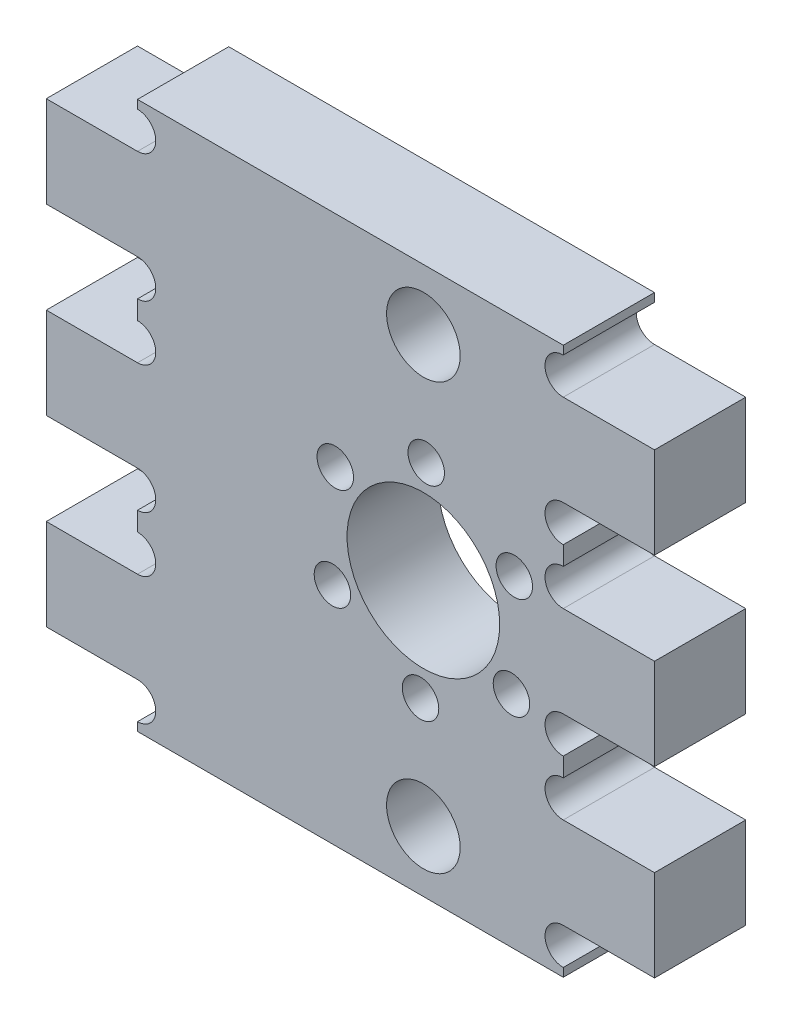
ISO-10303-21;
HEADER;
FILE_DESCRIPTION(('STEP AP214'),'2;1');
FILE_NAME('part.step','',(''),(''),'','','');
FILE_SCHEMA(('AUTOMOTIVE_DESIGN { 1 0 10303 214 1 1 1 1 }'));
ENDSEC;
DATA;
#1=APPLICATION_CONTEXT('core data for automotive mechanical design processes');
#2=APPLICATION_PROTOCOL_DEFINITION('international standard','automotive_design',2000,#1);
#3=PRODUCT_CONTEXT('',#1,'mechanical');
#4=PRODUCT('Part','Part','',(#3));
#5=PRODUCT_RELATED_PRODUCT_CATEGORY('part','',(#4));
#6=PRODUCT_DEFINITION_FORMATION('','',#4);
#7=PRODUCT_DEFINITION_CONTEXT('part definition',#1,'design');
#8=PRODUCT_DEFINITION('design','',#6,#7);
#9=PRODUCT_DEFINITION_SHAPE('','',#8);
#10=(LENGTH_UNIT() NAMED_UNIT(*) SI_UNIT(.MILLI.,.METRE.));
#11=(NAMED_UNIT(*) PLANE_ANGLE_UNIT() SI_UNIT($,.RADIAN.));
#12=(NAMED_UNIT(*) SI_UNIT($,.STERADIAN.) SOLID_ANGLE_UNIT());
#13=UNCERTAINTY_MEASURE_WITH_UNIT(LENGTH_MEASURE(1.E-05),#10,'distance_accuracy_value','');
#14=(GEOMETRIC_REPRESENTATION_CONTEXT(3) GLOBAL_UNCERTAINTY_ASSIGNED_CONTEXT((#13)) GLOBAL_UNIT_ASSIGNED_CONTEXT((#10,
#11,#12)) REPRESENTATION_CONTEXT('',''));
#15=CARTESIAN_POINT('',(0.,0.,0.));
#16=DIRECTION('',(0.,0.,1.));
#17=DIRECTION('',(1.,0.,0.));
#18=AXIS2_PLACEMENT_3D('',#15,#16,#17);
#19=CARTESIAN_POINT('',(96.5881133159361,34.5,15.));
#20=DIRECTION('',(0.,0.,-1.));
#21=DIRECTION('',(-1.,0.,0.));
#22=AXIS2_PLACEMENT_3D('',#19,#20,#21);
#23=CYLINDRICAL_SURFACE('',#22,3.00000000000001);
#24=CARTESIAN_POINT('',(96.5881133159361,34.5,0.));
#25=DIRECTION('',(0.,0.,-1.));
#26=DIRECTION('',(1.,0.,0.));
#27=AXIS2_PLACEMENT_3D('',#24,#25,#26);
#28=CIRCLE('',#27,3.00000000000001);
#29=CARTESIAN_POINT('',(96.5881133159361,31.5,0.));
#30=VERTEX_POINT('',#29);
#31=CARTESIAN_POINT('',(96.5881133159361,37.5,0.));
#32=VERTEX_POINT('',#31);
#33=EDGE_CURVE('E415',#30,#32,#28,.T.);
#34=ORIENTED_EDGE('',*,*,#33,.T.);
#35=DIRECTION('',(0.,0.,-1.));
#36=VECTOR('',#35,1.);
#37=CARTESIAN_POINT('',(96.5881133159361,37.5,15.));
#38=LINE('',#37,#36);
#39=CARTESIAN_POINT('',(96.5881133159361,37.5,15.));
#40=VERTEX_POINT('',#39);
#41=EDGE_CURVE('E11',#40,#32,#38,.T.);
#42=ORIENTED_EDGE('',*,*,#41,.F.);
#43=CARTESIAN_POINT('',(96.5881133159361,34.5,15.));
#44=DIRECTION('',(0.,0.,-1.));
#45=DIRECTION('',(1.,0.,0.));
#46=AXIS2_PLACEMENT_3D('',#43,#44,#45);
#47=CIRCLE('',#46,3.00000000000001);
#48=CARTESIAN_POINT('',(96.5881133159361,31.5,15.));
#49=VERTEX_POINT('',#48);
#50=EDGE_CURVE('E534',#49,#40,#47,.T.);
#51=ORIENTED_EDGE('',*,*,#50,.F.);
#52=DIRECTION('',(0.,0.,-1.));
#53=VECTOR('',#52,1.);
#54=CARTESIAN_POINT('',(96.5881133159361,31.5,15.));
#55=LINE('',#54,#53);
#56=EDGE_CURVE('E411',#49,#30,#55,.T.);
#57=ORIENTED_EDGE('',*,*,#56,.T.);
#58=EDGE_LOOP('',(#34,#42,#51,#57));
#59=FACE_BOUND('',#58,.T.);
#60=ADVANCED_FACE('F40',(#59),#23,.F.);
#61=CARTESIAN_POINT('',(96.5881133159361,37.5,15.));
#62=DIRECTION('',(0.,1.,0.));
#63=DIRECTION('',(-1.,0.,0.));
#64=AXIS2_PLACEMENT_3D('',#61,#62,#63);
#65=PLANE('',#64);
#66=DIRECTION('',(1.,0.,0.));
#67=VECTOR('',#66,1.);
#68=CARTESIAN_POINT('',(96.5881133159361,37.5,0.));
#69=LINE('',#68,#67);
#70=CARTESIAN_POINT('',(111.588113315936,37.5,0.));
#71=VERTEX_POINT('',#70);
#72=EDGE_CURVE('E419',#32,#71,#69,.T.);
#73=ORIENTED_EDGE('',*,*,#72,.T.);
#74=DIRECTION('',(0.,0.,-1.));
#75=VECTOR('',#74,1.);
#76=CARTESIAN_POINT('',(111.588113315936,37.5,15.));
#77=LINE('',#76,#75);
#78=CARTESIAN_POINT('',(111.588113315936,37.5,15.));
#79=VERTEX_POINT('',#78);
#80=EDGE_CURVE('E49',#79,#71,#77,.T.);
#81=ORIENTED_EDGE('',*,*,#80,.F.);
#82=DIRECTION('',(1.,0.,0.));
#83=VECTOR('',#82,1.);
#84=CARTESIAN_POINT('',(96.5881133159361,37.5,15.));
#85=LINE('',#84,#83);
#86=EDGE_CURVE('E240',#40,#79,#85,.T.);
#87=ORIENTED_EDGE('',*,*,#86,.F.);
#88=ORIENTED_EDGE('',*,*,#41,.T.);
#89=EDGE_LOOP('',(#73,#81,#87,#88));
#90=FACE_BOUND('',#89,.T.);
#91=ADVANCED_FACE('F873',(#90),#65,.F.);
#92=CARTESIAN_POINT('',(111.588113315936,37.5,15.));
#93=DIRECTION('',(-1.,0.,0.));
#94=DIRECTION('',(0.,0.,1.));
#95=AXIS2_PLACEMENT_3D('',#92,#93,#94);
#96=PLANE('',#95);
#97=DIRECTION('',(0.,1.,0.));
#98=VECTOR('',#97,1.);
#99=CARTESIAN_POINT('',(111.588113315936,37.5,0.));
#100=LINE('',#99,#98);
#101=CARTESIAN_POINT('',(111.588113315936,52.5,0.));
#102=VERTEX_POINT('',#101);
#103=EDGE_CURVE('E423',#71,#102,#100,.T.);
#104=ORIENTED_EDGE('',*,*,#103,.T.);
#105=DIRECTION('',(0.,0.,-1.));
#106=VECTOR('',#105,1.);
#107=CARTESIAN_POINT('',(111.588113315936,52.5,15.));
#108=LINE('',#107,#106);
#109=CARTESIAN_POINT('',(111.588113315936,52.5,15.));
#110=VERTEX_POINT('',#109);
#111=EDGE_CURVE('E672',#110,#102,#108,.T.);
#112=ORIENTED_EDGE('',*,*,#111,.F.);
#113=DIRECTION('',(0.,1.,0.));
#114=VECTOR('',#113,1.);
#115=CARTESIAN_POINT('',(111.588113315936,37.5,15.));
#116=LINE('',#115,#114);
#117=EDGE_CURVE('E682',#79,#110,#116,.T.);
#118=ORIENTED_EDGE('',*,*,#117,.F.);
#119=ORIENTED_EDGE('',*,*,#80,.T.);
#120=EDGE_LOOP('',(#104,#112,#118,#119));
#121=FACE_BOUND('',#120,.T.);
#122=ADVANCED_FACE('F680',(#121),#96,.F.);
#123=CARTESIAN_POINT('',(111.588113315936,52.5,15.));
#124=DIRECTION('',(0.,-1.,0.));
#125=DIRECTION('',(1.,0.,0.));
#126=AXIS2_PLACEMENT_3D('',#123,#124,#125);
#127=PLANE('',#126);
#128=DIRECTION('',(-1.,0.,0.));
#129=VECTOR('',#128,1.);
#130=CARTESIAN_POINT('',(111.588113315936,52.5,0.));
#131=LINE('',#130,#129);
#132=CARTESIAN_POINT('',(96.5881133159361,52.5,0.));
#133=VERTEX_POINT('',#132);
#134=EDGE_CURVE('E426',#102,#133,#131,.T.);
#135=ORIENTED_EDGE('',*,*,#134,.T.);
#136=DIRECTION('',(0.,0.,-1.));
#137=VECTOR('',#136,1.);
#138=CARTESIAN_POINT('',(96.5881133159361,52.5,15.));
#139=LINE('',#138,#137);
#140=CARTESIAN_POINT('',(96.5881133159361,52.5,15.));
#141=VERTEX_POINT('',#140);
#142=EDGE_CURVE('E668',#141,#133,#139,.T.);
#143=ORIENTED_EDGE('',*,*,#142,.F.);
#144=DIRECTION('',(-1.,0.,0.));
#145=VECTOR('',#144,1.);
#146=CARTESIAN_POINT('',(111.588113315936,52.5,15.));
#147=LINE('',#146,#145);
#148=EDGE_CURVE('E701',#110,#141,#147,.T.);
#149=ORIENTED_EDGE('',*,*,#148,.F.);
#150=ORIENTED_EDGE('',*,*,#111,.T.);
#151=EDGE_LOOP('',(#135,#143,#149,#150));
#152=FACE_BOUND('',#151,.T.);
#153=ADVANCED_FACE('F691',(#152),#127,.F.);
#154=CARTESIAN_POINT('',(96.5881133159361,55.5,15.));
#155=DIRECTION('',(0.,0.,-1.));
#156=DIRECTION('',(-1.,0.,0.));
#157=AXIS2_PLACEMENT_3D('',#154,#155,#156);
#158=CYLINDRICAL_SURFACE('',#157,3.);
#159=CARTESIAN_POINT('',(96.5881133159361,55.5,0.));
#160=DIRECTION('',(0.,0.,-1.));
#161=DIRECTION('',(1.,0.,0.));
#162=AXIS2_PLACEMENT_3D('',#159,#160,#161);
#163=CIRCLE('',#162,3.);
#164=CARTESIAN_POINT('',(96.5881133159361,58.5,0.));
#165=VERTEX_POINT('',#164);
#166=EDGE_CURVE('E429',#133,#165,#163,.T.);
#167=ORIENTED_EDGE('',*,*,#166,.T.);
#168=DIRECTION('',(0.,0.,-1.));
#169=VECTOR('',#168,1.);
#170=CARTESIAN_POINT('',(96.5881133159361,58.5,15.));
#171=LINE('',#170,#169);
#172=CARTESIAN_POINT('',(96.5881133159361,58.5,15.));
#173=VERTEX_POINT('',#172);
#174=EDGE_CURVE('E664',#173,#165,#171,.T.);
#175=ORIENTED_EDGE('',*,*,#174,.F.);
#176=CARTESIAN_POINT('',(96.5881133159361,55.5,15.));
#177=DIRECTION('',(0.,0.,-1.));
#178=DIRECTION('',(1.,0.,0.));
#179=AXIS2_PLACEMENT_3D('',#176,#177,#178);
#180=CIRCLE('',#179,3.);
#181=EDGE_CURVE('E697',#141,#173,#180,.T.);
#182=ORIENTED_EDGE('',*,*,#181,.F.);
#183=ORIENTED_EDGE('',*,*,#142,.T.);
#184=EDGE_LOOP('',(#167,#175,#182,#183));
#185=FACE_BOUND('',#184,.T.);
#186=ADVANCED_FACE('F695',(#185),#158,.F.);
#187=CARTESIAN_POINT('',(96.5881133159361,61.6,15.));
#188=DIRECTION('',(-1.,0.,0.));
#189=DIRECTION('',(0.,-1.,0.));
#190=AXIS2_PLACEMENT_3D('',#187,#188,#189);
#191=PLANE('',#190);
#192=DIRECTION('',(0.,1.,0.));
#193=VECTOR('',#192,1.);
#194=CARTESIAN_POINT('',(96.5881133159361,61.6,0.));
#195=LINE('',#194,#193);
#196=CARTESIAN_POINT('',(96.5881133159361,61.6,0.));
#197=VERTEX_POINT('',#196);
#198=EDGE_CURVE('E432',#165,#197,#195,.T.);
#199=ORIENTED_EDGE('',*,*,#198,.T.);
#200=DIRECTION('',(0.,0.,-1.));
#201=VECTOR('',#200,1.);
#202=CARTESIAN_POINT('',(96.5881133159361,61.6,15.));
#203=LINE('',#202,#201);
#204=CARTESIAN_POINT('',(96.5881133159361,61.6,15.));
#205=VERTEX_POINT('',#204);
#206=EDGE_CURVE('E660',#205,#197,#203,.T.);
#207=ORIENTED_EDGE('',*,*,#206,.F.);
#208=DIRECTION('',(0.,1.,0.));
#209=VECTOR('',#208,1.);
#210=CARTESIAN_POINT('',(96.5881133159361,61.6,15.));
#211=LINE('',#210,#209);
#212=EDGE_CURVE('E700',#173,#205,#211,.T.);
#213=ORIENTED_EDGE('',*,*,#212,.F.);
#214=ORIENTED_EDGE('',*,*,#174,.T.);
#215=EDGE_LOOP('',(#199,#207,#213,#214));
#216=FACE_BOUND('',#215,.T.);
#217=ADVANCED_FACE('F885',(#216),#191,.F.);
#218=CARTESIAN_POINT('',(96.5881133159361,64.6,15.));
#219=DIRECTION('',(0.,0.,-1.));
#220=DIRECTION('',(-1.,0.,0.));
#221=AXIS2_PLACEMENT_3D('',#218,#219,#220);
#222=CYLINDRICAL_SURFACE('',#221,3.00000000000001);
#223=CARTESIAN_POINT('',(96.5881133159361,64.6,0.));
#224=DIRECTION('',(0.,0.,-1.));
#225=DIRECTION('',(1.,0.,0.));
#226=AXIS2_PLACEMENT_3D('',#223,#224,#225);
#227=CIRCLE('',#226,3.00000000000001);
#228=CARTESIAN_POINT('',(96.5881133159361,67.6,0.));
#229=VERTEX_POINT('',#228);
#230=EDGE_CURVE('E435',#197,#229,#227,.T.);
#231=ORIENTED_EDGE('',*,*,#230,.T.);
#232=DIRECTION('',(0.,0.,-1.));
#233=VECTOR('',#232,1.);
#234=CARTESIAN_POINT('',(96.5881133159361,67.6,15.));
#235=LINE('',#234,#233);
#236=CARTESIAN_POINT('',(96.5881133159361,67.6,15.));
#237=VERTEX_POINT('',#236);
#238=EDGE_CURVE('E656',#237,#229,#235,.T.);
#239=ORIENTED_EDGE('',*,*,#238,.F.);
#240=CARTESIAN_POINT('',(96.5881133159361,64.6,15.));
#241=DIRECTION('',(0.,0.,-1.));
#242=DIRECTION('',(1.,0.,0.));
#243=AXIS2_PLACEMENT_3D('',#240,#241,#242);
#244=CIRCLE('',#243,3.00000000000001);
#245=EDGE_CURVE('E705',#205,#237,#244,.T.);
#246=ORIENTED_EDGE('',*,*,#245,.F.);
#247=ORIENTED_EDGE('',*,*,#206,.T.);
#248=EDGE_LOOP('',(#231,#239,#246,#247));
#249=FACE_BOUND('',#248,.T.);
#250=ADVANCED_FACE('F888',(#249),#222,.F.);
#251=CARTESIAN_POINT('',(96.5881133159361,67.6,15.));
#252=DIRECTION('',(0.,1.,0.));
#253=DIRECTION('',(-1.,0.,0.));
#254=AXIS2_PLACEMENT_3D('',#251,#252,#253);
#255=PLANE('',#254);
#256=DIRECTION('',(1.,0.,0.));
#257=VECTOR('',#256,1.);
#258=CARTESIAN_POINT('',(96.5881133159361,67.6,0.));
#259=LINE('',#258,#257);
#260=CARTESIAN_POINT('',(111.588113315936,67.6,0.));
#261=VERTEX_POINT('',#260);
#262=EDGE_CURVE('E438',#229,#261,#259,.T.);
#263=ORIENTED_EDGE('',*,*,#262,.T.);
#264=DIRECTION('',(0.,0.,-1.));
#265=VECTOR('',#264,1.);
#266=CARTESIAN_POINT('',(111.588113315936,67.6,15.));
#267=LINE('',#266,#265);
#268=CARTESIAN_POINT('',(111.588113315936,67.6,15.));
#269=VERTEX_POINT('',#268);
#270=EDGE_CURVE('E652',#269,#261,#267,.T.);
#271=ORIENTED_EDGE('',*,*,#270,.F.);
#272=DIRECTION('',(1.,0.,0.));
#273=VECTOR('',#272,1.);
#274=CARTESIAN_POINT('',(96.5881133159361,67.6,15.));
#275=LINE('',#274,#273);
#276=EDGE_CURVE('E712',#237,#269,#275,.T.);
#277=ORIENTED_EDGE('',*,*,#276,.F.);
#278=ORIENTED_EDGE('',*,*,#238,.T.);
#279=EDGE_LOOP('',(#263,#271,#277,#278));
#280=FACE_BOUND('',#279,.T.);
#281=ADVANCED_FACE('F892',(#280),#255,.F.);
#282=CARTESIAN_POINT('',(111.588113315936,67.6,15.));
#283=DIRECTION('',(-1.,0.,0.));
#284=DIRECTION('',(0.,0.,1.));
#285=AXIS2_PLACEMENT_3D('',#282,#283,#284);
#286=PLANE('',#285);
#287=DIRECTION('',(0.,1.,0.));
#288=VECTOR('',#287,1.);
#289=CARTESIAN_POINT('',(111.588113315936,67.6,0.));
#290=LINE('',#289,#288);
#291=CARTESIAN_POINT('',(111.588113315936,82.6,0.));
#292=VERTEX_POINT('',#291);
#293=EDGE_CURVE('E441',#261,#292,#290,.T.);
#294=ORIENTED_EDGE('',*,*,#293,.T.);
#295=DIRECTION('',(0.,0.,-1.));
#296=VECTOR('',#295,1.);
#297=CARTESIAN_POINT('',(111.588113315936,82.6,15.));
#298=LINE('',#297,#296);
#299=CARTESIAN_POINT('',(111.588113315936,82.6,15.));
#300=VERTEX_POINT('',#299);
#301=EDGE_CURVE('E648',#300,#292,#298,.T.);
#302=ORIENTED_EDGE('',*,*,#301,.F.);
#303=DIRECTION('',(0.,1.,0.));
#304=VECTOR('',#303,1.);
#305=CARTESIAN_POINT('',(111.588113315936,67.6,15.));
#306=LINE('',#305,#304);
#307=EDGE_CURVE('E715',#269,#300,#306,.T.);
#308=ORIENTED_EDGE('',*,*,#307,.F.);
#309=ORIENTED_EDGE('',*,*,#270,.T.);
#310=EDGE_LOOP('',(#294,#302,#308,#309));
#311=FACE_BOUND('',#310,.T.);
#312=ADVANCED_FACE('F896',(#311),#286,.F.);
#313=CARTESIAN_POINT('',(111.588113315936,82.6,15.));
#314=DIRECTION('',(0.,-1.,0.));
#315=DIRECTION('',(1.,0.,0.));
#316=AXIS2_PLACEMENT_3D('',#313,#314,#315);
#317=PLANE('',#316);
#318=DIRECTION('',(-1.,0.,0.));
#319=VECTOR('',#318,1.);
#320=CARTESIAN_POINT('',(111.588113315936,82.6,0.));
#321=LINE('',#320,#319);
#322=CARTESIAN_POINT('',(96.5881133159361,82.6,0.));
#323=VERTEX_POINT('',#322);
#324=EDGE_CURVE('E444',#292,#323,#321,.T.);
#325=ORIENTED_EDGE('',*,*,#324,.T.);
#326=DIRECTION('',(0.,0.,-1.));
#327=VECTOR('',#326,1.);
#328=CARTESIAN_POINT('',(96.5881133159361,82.6,15.));
#329=LINE('',#328,#327);
#330=CARTESIAN_POINT('',(96.5881133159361,82.6,15.));
#331=VERTEX_POINT('',#330);
#332=EDGE_CURVE('E644',#331,#323,#329,.T.);
#333=ORIENTED_EDGE('',*,*,#332,.F.);
#334=DIRECTION('',(-1.,0.,0.));
#335=VECTOR('',#334,1.);
#336=CARTESIAN_POINT('',(111.588113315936,82.6,15.));
#337=LINE('',#336,#335);
#338=EDGE_CURVE('E718',#300,#331,#337,.T.);
#339=ORIENTED_EDGE('',*,*,#338,.F.);
#340=ORIENTED_EDGE('',*,*,#301,.T.);
#341=EDGE_LOOP('',(#325,#333,#339,#340));
#342=FACE_BOUND('',#341,.T.);
#343=ADVANCED_FACE('F900',(#342),#317,.F.);
#344=CARTESIAN_POINT('',(96.5881133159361,85.6,15.));
#345=DIRECTION('',(0.,0.,-1.));
#346=DIRECTION('',(-1.,0.,0.));
#347=AXIS2_PLACEMENT_3D('',#344,#345,#346);
#348=CYLINDRICAL_SURFACE('',#347,3.);
#349=CARTESIAN_POINT('',(96.5881133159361,85.6,0.));
#350=DIRECTION('',(0.,0.,-1.));
#351=DIRECTION('',(1.,0.,0.));
#352=AXIS2_PLACEMENT_3D('',#349,#350,#351);
#353=CIRCLE('',#352,3.);
#354=CARTESIAN_POINT('',(96.5881133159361,88.6,0.));
#355=VERTEX_POINT('',#354);
#356=EDGE_CURVE('E447',#323,#355,#353,.T.);
#357=ORIENTED_EDGE('',*,*,#356,.T.);
#358=DIRECTION('',(0.,0.,-1.));
#359=VECTOR('',#358,1.);
#360=CARTESIAN_POINT('',(96.5881133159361,88.6,15.));
#361=LINE('',#360,#359);
#362=CARTESIAN_POINT('',(96.5881133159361,88.6,15.));
#363=VERTEX_POINT('',#362);
#364=EDGE_CURVE('E640',#363,#355,#361,.T.);
#365=ORIENTED_EDGE('',*,*,#364,.F.);
#366=CARTESIAN_POINT('',(96.5881133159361,85.6,15.));
#367=DIRECTION('',(0.,0.,-1.));
#368=DIRECTION('',(1.,0.,0.));
#369=AXIS2_PLACEMENT_3D('',#366,#367,#368);
#370=CIRCLE('',#369,3.);
#371=EDGE_CURVE('E721',#331,#363,#370,.T.);
#372=ORIENTED_EDGE('',*,*,#371,.F.);
#373=ORIENTED_EDGE('',*,*,#332,.T.);
#374=EDGE_LOOP('',(#357,#365,#372,#373));
#375=FACE_BOUND('',#374,.T.);
#376=ADVANCED_FACE('F904',(#375),#348,.F.);
#377=CARTESIAN_POINT('',(96.5881133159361,90.,15.));
#378=DIRECTION('',(-1.,0.,0.));
#379=DIRECTION('',(0.,-1.,0.));
#380=AXIS2_PLACEMENT_3D('',#377,#378,#379);
#381=PLANE('',#380);
#382=DIRECTION('',(0.,1.,0.));
#383=VECTOR('',#382,1.);
#384=CARTESIAN_POINT('',(96.5881133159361,90.,0.));
#385=LINE('',#384,#383);
#386=CARTESIAN_POINT('',(96.5881133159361,90.,0.));
#387=VERTEX_POINT('',#386);
#388=EDGE_CURVE('E450',#355,#387,#385,.T.);
#389=ORIENTED_EDGE('',*,*,#388,.T.);
#390=DIRECTION('',(0.,0.,-1.));
#391=VECTOR('',#390,1.);
#392=CARTESIAN_POINT('',(96.5881133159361,90.,15.));
#393=LINE('',#392,#391);
#394=CARTESIAN_POINT('',(96.5881133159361,90.,15.));
#395=VERTEX_POINT('',#394);
#396=EDGE_CURVE('E636',#395,#387,#393,.T.);
#397=ORIENTED_EDGE('',*,*,#396,.F.);
#398=DIRECTION('',(0.,1.,0.));
#399=VECTOR('',#398,1.);
#400=CARTESIAN_POINT('',(96.5881133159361,90.,15.));
#401=LINE('',#400,#399);
#402=EDGE_CURVE('E724',#363,#395,#401,.T.);
#403=ORIENTED_EDGE('',*,*,#402,.F.);
#404=ORIENTED_EDGE('',*,*,#364,.T.);
#405=EDGE_LOOP('',(#389,#397,#403,#404));
#406=FACE_BOUND('',#405,.T.);
#407=ADVANCED_FACE('F908',(#406),#381,.F.);
#408=CARTESIAN_POINT('',(26.5881133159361,90.,15.));
#409=DIRECTION('',(0.,-1.,0.));
#410=DIRECTION('',(1.,0.,0.));
#411=AXIS2_PLACEMENT_3D('',#408,#409,#410);
#412=PLANE('',#411);
#413=DIRECTION('',(-1.,0.,0.));
#414=VECTOR('',#413,1.);
#415=CARTESIAN_POINT('',(26.5881133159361,90.,0.));
#416=LINE('',#415,#414);
#417=CARTESIAN_POINT('',(26.5881133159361,90.,0.));
#418=VERTEX_POINT('',#417);
#419=EDGE_CURVE('E453',#387,#418,#416,.T.);
#420=ORIENTED_EDGE('',*,*,#419,.T.);
#421=DIRECTION('',(0.,0.,-1.));
#422=VECTOR('',#421,1.);
#423=CARTESIAN_POINT('',(26.5881133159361,90.,15.));
#424=LINE('',#423,#422);
#425=CARTESIAN_POINT('',(26.5881133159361,90.,15.));
#426=VERTEX_POINT('',#425);
#427=EDGE_CURVE('E632',#426,#418,#424,.T.);
#428=ORIENTED_EDGE('',*,*,#427,.F.);
#429=DIRECTION('',(-1.,0.,0.));
#430=VECTOR('',#429,1.);
#431=CARTESIAN_POINT('',(26.5881133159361,90.,15.));
#432=LINE('',#431,#430);
#433=EDGE_CURVE('E727',#395,#426,#432,.T.);
#434=ORIENTED_EDGE('',*,*,#433,.F.);
#435=ORIENTED_EDGE('',*,*,#396,.T.);
#436=EDGE_LOOP('',(#420,#428,#434,#435));
#437=FACE_BOUND('',#436,.T.);
#438=ADVANCED_FACE('F912',(#437),#412,.F.);
#439=CARTESIAN_POINT('',(26.5881133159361,90.,15.));
#440=DIRECTION('',(1.,0.,0.));
#441=DIRECTION('',(0.,0.,-1.));
#442=AXIS2_PLACEMENT_3D('',#439,#440,#441);
#443=PLANE('',#442);
#444=DIRECTION('',(0.,-1.,0.));
#445=VECTOR('',#444,1.);
#446=CARTESIAN_POINT('',(26.5881133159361,90.,0.));
#447=LINE('',#446,#445);
#448=CARTESIAN_POINT('',(26.5881133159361,88.6,0.));
#449=VERTEX_POINT('',#448);
#450=EDGE_CURVE('E456',#418,#449,#447,.T.);
#451=ORIENTED_EDGE('',*,*,#450,.T.);
#452=DIRECTION('',(0.,0.,-1.));
#453=VECTOR('',#452,1.);
#454=CARTESIAN_POINT('',(26.5881133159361,88.6,15.));
#455=LINE('',#454,#453);
#456=CARTESIAN_POINT('',(26.5881133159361,88.6,15.));
#457=VERTEX_POINT('',#456);
#458=EDGE_CURVE('E628',#457,#449,#455,.T.);
#459=ORIENTED_EDGE('',*,*,#458,.F.);
#460=DIRECTION('',(0.,-1.,0.));
#461=VECTOR('',#460,1.);
#462=CARTESIAN_POINT('',(26.5881133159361,90.,15.));
#463=LINE('',#462,#461);
#464=EDGE_CURVE('E730',#426,#457,#463,.T.);
#465=ORIENTED_EDGE('',*,*,#464,.F.);
#466=ORIENTED_EDGE('',*,*,#427,.T.);
#467=EDGE_LOOP('',(#451,#459,#465,#466));
#468=FACE_BOUND('',#467,.T.);
#469=ADVANCED_FACE('F916',(#468),#443,.F.);
#470=CARTESIAN_POINT('',(26.5881133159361,85.6,15.));
#471=DIRECTION('',(0.,0.,-1.));
#472=DIRECTION('',(-1.,0.,0.));
#473=AXIS2_PLACEMENT_3D('',#470,#471,#472);
#474=CYLINDRICAL_SURFACE('',#473,3.);
#475=CARTESIAN_POINT('',(26.5881133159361,85.6,0.));
#476=DIRECTION('',(0.,0.,-1.));
#477=DIRECTION('',(-1.,0.,0.));
#478=AXIS2_PLACEMENT_3D('',#475,#476,#477);
#479=CIRCLE('',#478,3.);
#480=CARTESIAN_POINT('',(26.5881133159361,82.6,0.));
#481=VERTEX_POINT('',#480);
#482=EDGE_CURVE('E459',#449,#481,#479,.T.);
#483=ORIENTED_EDGE('',*,*,#482,.T.);
#484=DIRECTION('',(0.,0.,-1.));
#485=VECTOR('',#484,1.);
#486=CARTESIAN_POINT('',(26.5881133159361,82.6,15.));
#487=LINE('',#486,#485);
#488=CARTESIAN_POINT('',(26.5881133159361,82.6,15.));
#489=VERTEX_POINT('',#488);
#490=EDGE_CURVE('E624',#489,#481,#487,.T.);
#491=ORIENTED_EDGE('',*,*,#490,.F.);
#492=CARTESIAN_POINT('',(26.5881133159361,85.6,15.));
#493=DIRECTION('',(0.,0.,-1.));
#494=DIRECTION('',(-1.,0.,0.));
#495=AXIS2_PLACEMENT_3D('',#492,#493,#494);
#496=CIRCLE('',#495,3.);
#497=EDGE_CURVE('E733',#457,#489,#496,.T.);
#498=ORIENTED_EDGE('',*,*,#497,.F.);
#499=ORIENTED_EDGE('',*,*,#458,.T.);
#500=EDGE_LOOP('',(#483,#491,#498,#499));
#501=FACE_BOUND('',#500,.T.);
#502=ADVANCED_FACE('F920',(#501),#474,.F.);
#503=CARTESIAN_POINT('',(11.5881133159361,82.6,15.));
#504=DIRECTION('',(0.,-1.,0.));
#505=DIRECTION('',(0.,0.,-1.));
#506=AXIS2_PLACEMENT_3D('',#503,#504,#505);
#507=PLANE('',#506);
#508=DIRECTION('',(-1.,0.,0.));
#509=VECTOR('',#508,1.);
#510=CARTESIAN_POINT('',(11.5881133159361,82.6,0.));
#511=LINE('',#510,#509);
#512=CARTESIAN_POINT('',(11.5881133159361,82.6,0.));
#513=VERTEX_POINT('',#512);
#514=EDGE_CURVE('E462',#481,#513,#511,.T.);
#515=ORIENTED_EDGE('',*,*,#514,.T.);
#516=DIRECTION('',(0.,0.,-1.));
#517=VECTOR('',#516,1.);
#518=CARTESIAN_POINT('',(11.5881133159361,82.6,15.));
#519=LINE('',#518,#517);
#520=CARTESIAN_POINT('',(11.5881133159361,82.6,15.));
#521=VERTEX_POINT('',#520);
#522=EDGE_CURVE('E620',#521,#513,#519,.T.);
#523=ORIENTED_EDGE('',*,*,#522,.F.);
#524=DIRECTION('',(-1.,0.,0.));
#525=VECTOR('',#524,1.);
#526=CARTESIAN_POINT('',(11.5881133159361,82.6,15.));
#527=LINE('',#526,#525);
#528=EDGE_CURVE('E736',#489,#521,#527,.T.);
#529=ORIENTED_EDGE('',*,*,#528,.F.);
#530=ORIENTED_EDGE('',*,*,#490,.T.);
#531=EDGE_LOOP('',(#515,#523,#529,#530));
#532=FACE_BOUND('',#531,.T.);
#533=ADVANCED_FACE('F924',(#532),#507,.F.);
#534=CARTESIAN_POINT('',(11.5881133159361,67.6,15.));
#535=DIRECTION('',(1.,0.,0.));
#536=DIRECTION('',(0.,0.,-1.));
#537=AXIS2_PLACEMENT_3D('',#534,#535,#536);
#538=PLANE('',#537);
#539=DIRECTION('',(0.,-1.,0.));
#540=VECTOR('',#539,1.);
#541=CARTESIAN_POINT('',(11.5881133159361,67.6,0.));
#542=LINE('',#541,#540);
#543=CARTESIAN_POINT('',(11.5881133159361,67.6,0.));
#544=VERTEX_POINT('',#543);
#545=EDGE_CURVE('E465',#513,#544,#542,.T.);
#546=ORIENTED_EDGE('',*,*,#545,.T.);
#547=DIRECTION('',(0.,0.,-1.));
#548=VECTOR('',#547,1.);
#549=CARTESIAN_POINT('',(11.5881133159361,67.6,15.));
#550=LINE('',#549,#548);
#551=CARTESIAN_POINT('',(11.5881133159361,67.6,15.));
#552=VERTEX_POINT('',#551);
#553=EDGE_CURVE('E616',#552,#544,#550,.T.);
#554=ORIENTED_EDGE('',*,*,#553,.F.);
#555=DIRECTION('',(0.,-1.,0.));
#556=VECTOR('',#555,1.);
#557=CARTESIAN_POINT('',(11.5881133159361,67.6,15.));
#558=LINE('',#557,#556);
#559=EDGE_CURVE('E739',#521,#552,#558,.T.);
#560=ORIENTED_EDGE('',*,*,#559,.F.);
#561=ORIENTED_EDGE('',*,*,#522,.T.);
#562=EDGE_LOOP('',(#546,#554,#560,#561));
#563=FACE_BOUND('',#562,.T.);
#564=ADVANCED_FACE('F928',(#563),#538,.F.);
#565=CARTESIAN_POINT('',(26.5881133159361,67.6,15.));
#566=DIRECTION('',(0.,1.,0.));
#567=DIRECTION('',(0.,0.,1.));
#568=AXIS2_PLACEMENT_3D('',#565,#566,#567);
#569=PLANE('',#568);
#570=DIRECTION('',(1.,0.,0.));
#571=VECTOR('',#570,1.);
#572=CARTESIAN_POINT('',(26.5881133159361,67.6,0.));
#573=LINE('',#572,#571);
#574=CARTESIAN_POINT('',(26.5881133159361,67.6,0.));
#575=VERTEX_POINT('',#574);
#576=EDGE_CURVE('E468',#544,#575,#573,.T.);
#577=ORIENTED_EDGE('',*,*,#576,.T.);
#578=DIRECTION('',(0.,0.,-1.));
#579=VECTOR('',#578,1.);
#580=CARTESIAN_POINT('',(26.5881133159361,67.6,15.));
#581=LINE('',#580,#579);
#582=CARTESIAN_POINT('',(26.5881133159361,67.6,15.));
#583=VERTEX_POINT('',#582);
#584=EDGE_CURVE('E612',#583,#575,#581,.T.);
#585=ORIENTED_EDGE('',*,*,#584,.F.);
#586=DIRECTION('',(1.,0.,0.));
#587=VECTOR('',#586,1.);
#588=CARTESIAN_POINT('',(26.5881133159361,67.6,15.));
#589=LINE('',#588,#587);
#590=EDGE_CURVE('E742',#552,#583,#589,.T.);
#591=ORIENTED_EDGE('',*,*,#590,.F.);
#592=ORIENTED_EDGE('',*,*,#553,.T.);
#593=EDGE_LOOP('',(#577,#585,#591,#592));
#594=FACE_BOUND('',#593,.T.);
#595=ADVANCED_FACE('F931',(#594),#569,.F.);
#596=CARTESIAN_POINT('',(26.5881133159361,64.6,15.));
#597=DIRECTION('',(0.,0.,-1.));
#598=DIRECTION('',(-1.,0.,0.));
#599=AXIS2_PLACEMENT_3D('',#596,#597,#598);
#600=CYLINDRICAL_SURFACE('',#599,3.);
#601=CARTESIAN_POINT('',(26.5881133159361,64.6,0.));
#602=DIRECTION('',(0.,0.,-1.));
#603=DIRECTION('',(-1.,0.,0.));
#604=AXIS2_PLACEMENT_3D('',#601,#602,#603);
#605=CIRCLE('',#604,3.);
#606=CARTESIAN_POINT('',(26.5881133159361,61.6,0.));
#607=VERTEX_POINT('',#606);
#608=EDGE_CURVE('E471',#575,#607,#605,.T.);
#609=ORIENTED_EDGE('',*,*,#608,.T.);
#610=DIRECTION('',(0.,0.,-1.));
#611=VECTOR('',#610,1.);
#612=CARTESIAN_POINT('',(26.5881133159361,61.6,15.));
#613=LINE('',#612,#611);
#614=CARTESIAN_POINT('',(26.5881133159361,61.6,15.));
#615=VERTEX_POINT('',#614);
#616=EDGE_CURVE('E608',#615,#607,#613,.T.);
#617=ORIENTED_EDGE('',*,*,#616,.F.);
#618=CARTESIAN_POINT('',(26.5881133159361,64.6,15.));
#619=DIRECTION('',(0.,0.,-1.));
#620=DIRECTION('',(-1.,0.,0.));
#621=AXIS2_PLACEMENT_3D('',#618,#619,#620);
#622=CIRCLE('',#621,3.);
#623=EDGE_CURVE('E745',#583,#615,#622,.T.);
#624=ORIENTED_EDGE('',*,*,#623,.F.);
#625=ORIENTED_EDGE('',*,*,#584,.T.);
#626=EDGE_LOOP('',(#609,#617,#624,#625));
#627=FACE_BOUND('',#626,.T.);
#628=ADVANCED_FACE('F935',(#627),#600,.F.);
#629=CARTESIAN_POINT('',(26.5881133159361,61.6,15.));
#630=DIRECTION('',(1.,0.,0.));
#631=DIRECTION('',(0.,1.,0.));
#632=AXIS2_PLACEMENT_3D('',#629,#630,#631);
#633=PLANE('',#632);
#634=DIRECTION('',(0.,-1.,0.));
#635=VECTOR('',#634,1.);
#636=CARTESIAN_POINT('',(26.5881133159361,61.6,0.));
#637=LINE('',#636,#635);
#638=CARTESIAN_POINT('',(26.5881133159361,58.5,0.));
#639=VERTEX_POINT('',#638);
#640=EDGE_CURVE('E474',#607,#639,#637,.T.);
#641=ORIENTED_EDGE('',*,*,#640,.T.);
#642=DIRECTION('',(0.,0.,-1.));
#643=VECTOR('',#642,1.);
#644=CARTESIAN_POINT('',(26.5881133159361,58.5,15.));
#645=LINE('',#644,#643);
#646=CARTESIAN_POINT('',(26.5881133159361,58.5,15.));
#647=VERTEX_POINT('',#646);
#648=EDGE_CURVE('E604',#647,#639,#645,.T.);
#649=ORIENTED_EDGE('',*,*,#648,.F.);
#650=DIRECTION('',(0.,-1.,0.));
#651=VECTOR('',#650,1.);
#652=CARTESIAN_POINT('',(26.5881133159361,61.6,15.));
#653=LINE('',#652,#651);
#654=EDGE_CURVE('E748',#615,#647,#653,.T.);
#655=ORIENTED_EDGE('',*,*,#654,.F.);
#656=ORIENTED_EDGE('',*,*,#616,.T.);
#657=EDGE_LOOP('',(#641,#649,#655,#656));
#658=FACE_BOUND('',#657,.T.);
#659=ADVANCED_FACE('F939',(#658),#633,.F.);
#660=CARTESIAN_POINT('',(26.5881133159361,55.5,15.));
#661=DIRECTION('',(0.,0.,-1.));
#662=DIRECTION('',(-1.,0.,0.));
#663=AXIS2_PLACEMENT_3D('',#660,#661,#662);
#664=CYLINDRICAL_SURFACE('',#663,3.);
#665=CARTESIAN_POINT('',(26.5881133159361,55.5,0.));
#666=DIRECTION('',(0.,0.,-1.));
#667=DIRECTION('',(-1.,0.,0.));
#668=AXIS2_PLACEMENT_3D('',#665,#666,#667);
#669=CIRCLE('',#668,3.);
#670=CARTESIAN_POINT('',(26.5881133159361,52.5,0.));
#671=VERTEX_POINT('',#670);
#672=EDGE_CURVE('E477',#639,#671,#669,.T.);
#673=ORIENTED_EDGE('',*,*,#672,.T.);
#674=DIRECTION('',(0.,0.,-1.));
#675=VECTOR('',#674,1.);
#676=CARTESIAN_POINT('',(26.5881133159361,52.5,15.));
#677=LINE('',#676,#675);
#678=CARTESIAN_POINT('',(26.5881133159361,52.5,15.));
#679=VERTEX_POINT('',#678);
#680=EDGE_CURVE('E600',#679,#671,#677,.T.);
#681=ORIENTED_EDGE('',*,*,#680,.F.);
#682=CARTESIAN_POINT('',(26.5881133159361,55.5,15.));
#683=DIRECTION('',(0.,0.,-1.));
#684=DIRECTION('',(-1.,0.,0.));
#685=AXIS2_PLACEMENT_3D('',#682,#683,#684);
#686=CIRCLE('',#685,3.);
#687=EDGE_CURVE('E751',#647,#679,#686,.T.);
#688=ORIENTED_EDGE('',*,*,#687,.F.);
#689=ORIENTED_EDGE('',*,*,#648,.T.);
#690=EDGE_LOOP('',(#673,#681,#688,#689));
#691=FACE_BOUND('',#690,.T.);
#692=ADVANCED_FACE('F943',(#691),#664,.F.);
#693=CARTESIAN_POINT('',(11.5881133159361,52.5,15.));
#694=DIRECTION('',(0.,-1.,0.));
#695=DIRECTION('',(0.,0.,-1.));
#696=AXIS2_PLACEMENT_3D('',#693,#694,#695);
#697=PLANE('',#696);
#698=DIRECTION('',(-1.,0.,0.));
#699=VECTOR('',#698,1.);
#700=CARTESIAN_POINT('',(11.5881133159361,52.5,0.));
#701=LINE('',#700,#699);
#702=CARTESIAN_POINT('',(11.5881133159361,52.5,0.));
#703=VERTEX_POINT('',#702);
#704=EDGE_CURVE('E480',#671,#703,#701,.T.);
#705=ORIENTED_EDGE('',*,*,#704,.T.);
#706=DIRECTION('',(0.,0.,-1.));
#707=VECTOR('',#706,1.);
#708=CARTESIAN_POINT('',(11.5881133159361,52.5,15.));
#709=LINE('',#708,#707);
#710=CARTESIAN_POINT('',(11.5881133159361,52.5,15.));
#711=VERTEX_POINT('',#710);
#712=EDGE_CURVE('E596',#711,#703,#709,.T.);
#713=ORIENTED_EDGE('',*,*,#712,.F.);
#714=DIRECTION('',(-1.,0.,0.));
#715=VECTOR('',#714,1.);
#716=CARTESIAN_POINT('',(11.5881133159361,52.5,15.));
#717=LINE('',#716,#715);
#718=EDGE_CURVE('E754',#679,#711,#717,.T.);
#719=ORIENTED_EDGE('',*,*,#718,.F.);
#720=ORIENTED_EDGE('',*,*,#680,.T.);
#721=EDGE_LOOP('',(#705,#713,#719,#720));
#722=FACE_BOUND('',#721,.T.);
#723=ADVANCED_FACE('F947',(#722),#697,.F.);
#724=CARTESIAN_POINT('',(11.5881133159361,37.5,15.));
#725=DIRECTION('',(1.,0.,0.));
#726=DIRECTION('',(0.,0.,-1.));
#727=AXIS2_PLACEMENT_3D('',#724,#725,#726);
#728=PLANE('',#727);
#729=DIRECTION('',(0.,-1.,0.));
#730=VECTOR('',#729,1.);
#731=CARTESIAN_POINT('',(11.5881133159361,37.5,0.));
#732=LINE('',#731,#730);
#733=CARTESIAN_POINT('',(11.5881133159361,37.5,0.));
#734=VERTEX_POINT('',#733);
#735=EDGE_CURVE('E483',#703,#734,#732,.T.);
#736=ORIENTED_EDGE('',*,*,#735,.T.);
#737=DIRECTION('',(0.,0.,-1.));
#738=VECTOR('',#737,1.);
#739=CARTESIAN_POINT('',(11.5881133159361,37.5,15.));
#740=LINE('',#739,#738);
#741=CARTESIAN_POINT('',(11.5881133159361,37.5,15.));
#742=VERTEX_POINT('',#741);
#743=EDGE_CURVE('E592',#742,#734,#740,.T.);
#744=ORIENTED_EDGE('',*,*,#743,.F.);
#745=DIRECTION('',(0.,-1.,0.));
#746=VECTOR('',#745,1.);
#747=CARTESIAN_POINT('',(11.5881133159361,37.5,15.));
#748=LINE('',#747,#746);
#749=EDGE_CURVE('E757',#711,#742,#748,.T.);
#750=ORIENTED_EDGE('',*,*,#749,.F.);
#751=ORIENTED_EDGE('',*,*,#712,.T.);
#752=EDGE_LOOP('',(#736,#744,#750,#751));
#753=FACE_BOUND('',#752,.T.);
#754=ADVANCED_FACE('F951',(#753),#728,.F.);
#755=CARTESIAN_POINT('',(26.5881133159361,37.5,15.));
#756=DIRECTION('',(0.,1.,0.));
#757=DIRECTION('',(-1.,0.,0.));
#758=AXIS2_PLACEMENT_3D('',#755,#756,#757);
#759=PLANE('',#758);
#760=DIRECTION('',(1.,0.,0.));
#761=VECTOR('',#760,1.);
#762=CARTESIAN_POINT('',(26.5881133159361,37.5,0.));
#763=LINE('',#762,#761);
#764=CARTESIAN_POINT('',(26.5881133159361,37.5,0.));
#765=VERTEX_POINT('',#764);
#766=EDGE_CURVE('E486',#734,#765,#763,.T.);
#767=ORIENTED_EDGE('',*,*,#766,.T.);
#768=DIRECTION('',(0.,0.,-1.));
#769=VECTOR('',#768,1.);
#770=CARTESIAN_POINT('',(26.5881133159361,37.5,15.));
#771=LINE('',#770,#769);
#772=CARTESIAN_POINT('',(26.5881133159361,37.5,15.));
#773=VERTEX_POINT('',#772);
#774=EDGE_CURVE('E588',#773,#765,#771,.T.);
#775=ORIENTED_EDGE('',*,*,#774,.F.);
#776=DIRECTION('',(1.,0.,0.));
#777=VECTOR('',#776,1.);
#778=CARTESIAN_POINT('',(26.5881133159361,37.5,15.));
#779=LINE('',#778,#777);
#780=EDGE_CURVE('E760',#742,#773,#779,.T.);
#781=ORIENTED_EDGE('',*,*,#780,.F.);
#782=ORIENTED_EDGE('',*,*,#743,.T.);
#783=EDGE_LOOP('',(#767,#775,#781,#782));
#784=FACE_BOUND('',#783,.T.);
#785=ADVANCED_FACE('F955',(#784),#759,.F.);
#786=CARTESIAN_POINT('',(26.5881133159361,34.5,15.));
#787=DIRECTION('',(0.,0.,-1.));
#788=DIRECTION('',(-1.,0.,0.));
#789=AXIS2_PLACEMENT_3D('',#786,#787,#788);
#790=CYLINDRICAL_SURFACE('',#789,3.00000000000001);
#791=CARTESIAN_POINT('',(26.5881133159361,34.5,0.));
#792=DIRECTION('',(0.,0.,-1.));
#793=DIRECTION('',(-1.,0.,0.));
#794=AXIS2_PLACEMENT_3D('',#791,#792,#793);
#795=CIRCLE('',#794,3.00000000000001);
#796=CARTESIAN_POINT('',(26.5881133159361,31.5,0.));
#797=VERTEX_POINT('',#796);
#798=EDGE_CURVE('E489',#765,#797,#795,.T.);
#799=ORIENTED_EDGE('',*,*,#798,.T.);
#800=DIRECTION('',(0.,0.,-1.));
#801=VECTOR('',#800,1.);
#802=CARTESIAN_POINT('',(26.5881133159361,31.5,15.));
#803=LINE('',#802,#801);
#804=CARTESIAN_POINT('',(26.5881133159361,31.5,15.));
#805=VERTEX_POINT('',#804);
#806=EDGE_CURVE('E584',#805,#797,#803,.T.);
#807=ORIENTED_EDGE('',*,*,#806,.F.);
#808=CARTESIAN_POINT('',(26.5881133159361,34.5,15.));
#809=DIRECTION('',(0.,0.,-1.));
#810=DIRECTION('',(-1.,0.,0.));
#811=AXIS2_PLACEMENT_3D('',#808,#809,#810);
#812=CIRCLE('',#811,3.00000000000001);
#813=EDGE_CURVE('E763',#773,#805,#812,.T.);
#814=ORIENTED_EDGE('',*,*,#813,.F.);
#815=ORIENTED_EDGE('',*,*,#774,.T.);
#816=EDGE_LOOP('',(#799,#807,#814,#815));
#817=FACE_BOUND('',#816,.T.);
#818=ADVANCED_FACE('F959',(#817),#790,.F.);
#819=CARTESIAN_POINT('',(26.5881133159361,31.5,15.));
#820=DIRECTION('',(1.,0.,0.));
#821=DIRECTION('',(0.,1.,0.));
#822=AXIS2_PLACEMENT_3D('',#819,#820,#821);
#823=PLANE('',#822);
#824=DIRECTION('',(0.,-1.,0.));
#825=VECTOR('',#824,1.);
#826=CARTESIAN_POINT('',(26.5881133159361,31.5,0.));
#827=LINE('',#826,#825);
#828=CARTESIAN_POINT('',(26.5881133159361,28.4,0.));
#829=VERTEX_POINT('',#828);
#830=EDGE_CURVE('E492',#797,#829,#827,.T.);
#831=ORIENTED_EDGE('',*,*,#830,.T.);
#832=DIRECTION('',(0.,0.,-1.));
#833=VECTOR('',#832,1.);
#834=CARTESIAN_POINT('',(26.5881133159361,28.4,15.));
#835=LINE('',#834,#833);
#836=CARTESIAN_POINT('',(26.5881133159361,28.4,15.));
#837=VERTEX_POINT('',#836);
#838=EDGE_CURVE('E580',#837,#829,#835,.T.);
#839=ORIENTED_EDGE('',*,*,#838,.F.);
#840=DIRECTION('',(0.,-1.,0.));
#841=VECTOR('',#840,1.);
#842=CARTESIAN_POINT('',(26.5881133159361,31.5,15.));
#843=LINE('',#842,#841);
#844=EDGE_CURVE('E766',#805,#837,#843,.T.);
#845=ORIENTED_EDGE('',*,*,#844,.F.);
#846=ORIENTED_EDGE('',*,*,#806,.T.);
#847=EDGE_LOOP('',(#831,#839,#845,#846));
#848=FACE_BOUND('',#847,.T.);
#849=ADVANCED_FACE('F963',(#848),#823,.F.);
#850=CARTESIAN_POINT('',(26.5881133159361,25.4,15.));
#851=DIRECTION('',(0.,0.,-1.));
#852=DIRECTION('',(-1.,0.,0.));
#853=AXIS2_PLACEMENT_3D('',#850,#851,#852);
#854=CYLINDRICAL_SURFACE('',#853,3.);
#855=CARTESIAN_POINT('',(26.5881133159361,25.4,0.));
#856=DIRECTION('',(0.,0.,-1.));
#857=DIRECTION('',(-1.,0.,0.));
#858=AXIS2_PLACEMENT_3D('',#855,#856,#857);
#859=CIRCLE('',#858,3.);
#860=CARTESIAN_POINT('',(26.5881133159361,22.4,0.));
#861=VERTEX_POINT('',#860);
#862=EDGE_CURVE('E495',#829,#861,#859,.T.);
#863=ORIENTED_EDGE('',*,*,#862,.T.);
#864=DIRECTION('',(0.,0.,-1.));
#865=VECTOR('',#864,1.);
#866=CARTESIAN_POINT('',(26.5881133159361,22.4,15.));
#867=LINE('',#866,#865);
#868=CARTESIAN_POINT('',(26.5881133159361,22.4,15.));
#869=VERTEX_POINT('',#868);
#870=EDGE_CURVE('E576',#869,#861,#867,.T.);
#871=ORIENTED_EDGE('',*,*,#870,.F.);
#872=CARTESIAN_POINT('',(26.5881133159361,25.4,15.));
#873=DIRECTION('',(0.,0.,-1.));
#874=DIRECTION('',(-1.,0.,0.));
#875=AXIS2_PLACEMENT_3D('',#872,#873,#874);
#876=CIRCLE('',#875,3.);
#877=EDGE_CURVE('E769',#837,#869,#876,.T.);
#878=ORIENTED_EDGE('',*,*,#877,.F.);
#879=ORIENTED_EDGE('',*,*,#838,.T.);
#880=EDGE_LOOP('',(#863,#871,#878,#879));
#881=FACE_BOUND('',#880,.T.);
#882=ADVANCED_FACE('F967',(#881),#854,.F.);
#883=CARTESIAN_POINT('',(11.5881133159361,22.4,15.));
#884=DIRECTION('',(0.,-1.,0.));
#885=DIRECTION('',(0.,0.,-1.));
#886=AXIS2_PLACEMENT_3D('',#883,#884,#885);
#887=PLANE('',#886);
#888=DIRECTION('',(-1.,0.,0.));
#889=VECTOR('',#888,1.);
#890=CARTESIAN_POINT('',(11.5881133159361,22.4,0.));
#891=LINE('',#890,#889);
#892=CARTESIAN_POINT('',(11.5881133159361,22.4,0.));
#893=VERTEX_POINT('',#892);
#894=EDGE_CURVE('E498',#861,#893,#891,.T.);
#895=ORIENTED_EDGE('',*,*,#894,.T.);
#896=DIRECTION('',(0.,0.,-1.));
#897=VECTOR('',#896,1.);
#898=CARTESIAN_POINT('',(11.5881133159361,22.4,15.));
#899=LINE('',#898,#897);
#900=CARTESIAN_POINT('',(11.5881133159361,22.4,15.));
#901=VERTEX_POINT('',#900);
#902=EDGE_CURVE('E572',#901,#893,#899,.T.);
#903=ORIENTED_EDGE('',*,*,#902,.F.);
#904=DIRECTION('',(-1.,0.,0.));
#905=VECTOR('',#904,1.);
#906=CARTESIAN_POINT('',(11.5881133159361,22.4,15.));
#907=LINE('',#906,#905);
#908=EDGE_CURVE('E772',#869,#901,#907,.T.);
#909=ORIENTED_EDGE('',*,*,#908,.F.);
#910=ORIENTED_EDGE('',*,*,#870,.T.);
#911=EDGE_LOOP('',(#895,#903,#909,#910));
#912=FACE_BOUND('',#911,.T.);
#913=ADVANCED_FACE('F971',(#912),#887,.F.);
#914=CARTESIAN_POINT('',(11.5881133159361,7.39999999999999,15.));
#915=DIRECTION('',(1.,0.,0.));
#916=DIRECTION('',(0.,0.,-1.));
#917=AXIS2_PLACEMENT_3D('',#914,#915,#916);
#918=PLANE('',#917);
#919=DIRECTION('',(0.,-1.,0.));
#920=VECTOR('',#919,1.);
#921=CARTESIAN_POINT('',(11.5881133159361,7.39999999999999,0.));
#922=LINE('',#921,#920);
#923=CARTESIAN_POINT('',(11.5881133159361,7.39999999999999,0.));
#924=VERTEX_POINT('',#923);
#925=EDGE_CURVE('E501',#893,#924,#922,.T.);
#926=ORIENTED_EDGE('',*,*,#925,.T.);
#927=DIRECTION('',(0.,0.,-1.));
#928=VECTOR('',#927,1.);
#929=CARTESIAN_POINT('',(11.5881133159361,7.39999999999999,15.));
#930=LINE('',#929,#928);
#931=CARTESIAN_POINT('',(11.5881133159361,7.39999999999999,15.));
#932=VERTEX_POINT('',#931);
#933=EDGE_CURVE('E568',#932,#924,#930,.T.);
#934=ORIENTED_EDGE('',*,*,#933,.F.);
#935=DIRECTION('',(0.,-1.,0.));
#936=VECTOR('',#935,1.);
#937=CARTESIAN_POINT('',(11.5881133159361,7.39999999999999,15.));
#938=LINE('',#937,#936);
#939=EDGE_CURVE('E775',#901,#932,#938,.T.);
#940=ORIENTED_EDGE('',*,*,#939,.F.);
#941=ORIENTED_EDGE('',*,*,#902,.T.);
#942=EDGE_LOOP('',(#926,#934,#940,#941));
#943=FACE_BOUND('',#942,.T.);
#944=ADVANCED_FACE('F975',(#943),#918,.F.);
#945=CARTESIAN_POINT('',(26.5881133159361,7.39999999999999,15.));
#946=DIRECTION('',(0.,1.,0.));
#947=DIRECTION('',(-1.,0.,0.));
#948=AXIS2_PLACEMENT_3D('',#945,#946,#947);
#949=PLANE('',#948);
#950=DIRECTION('',(1.,0.,0.));
#951=VECTOR('',#950,1.);
#952=CARTESIAN_POINT('',(26.5881133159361,7.39999999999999,0.));
#953=LINE('',#952,#951);
#954=CARTESIAN_POINT('',(26.5881133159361,7.39999999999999,0.));
#955=VERTEX_POINT('',#954);
#956=EDGE_CURVE('E504',#924,#955,#953,.T.);
#957=ORIENTED_EDGE('',*,*,#956,.T.);
#958=DIRECTION('',(0.,0.,-1.));
#959=VECTOR('',#958,1.);
#960=CARTESIAN_POINT('',(26.5881133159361,7.39999999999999,15.));
#961=LINE('',#960,#959);
#962=CARTESIAN_POINT('',(26.5881133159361,7.39999999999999,15.));
#963=VERTEX_POINT('',#962);
#964=EDGE_CURVE('E564',#963,#955,#961,.T.);
#965=ORIENTED_EDGE('',*,*,#964,.F.);
#966=DIRECTION('',(1.,0.,0.));
#967=VECTOR('',#966,1.);
#968=CARTESIAN_POINT('',(26.5881133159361,7.39999999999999,15.));
#969=LINE('',#968,#967);
#970=EDGE_CURVE('E778',#932,#963,#969,.T.);
#971=ORIENTED_EDGE('',*,*,#970,.F.);
#972=ORIENTED_EDGE('',*,*,#933,.T.);
#973=EDGE_LOOP('',(#957,#965,#971,#972));
#974=FACE_BOUND('',#973,.T.);
#975=ADVANCED_FACE('F979',(#974),#949,.F.);
#976=CARTESIAN_POINT('',(26.5881133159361,4.39999999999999,15.));
#977=DIRECTION('',(0.,0.,-1.));
#978=DIRECTION('',(-1.,0.,0.));
#979=AXIS2_PLACEMENT_3D('',#976,#977,#978);
#980=CYLINDRICAL_SURFACE('',#979,3.);
#981=CARTESIAN_POINT('',(26.5881133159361,4.39999999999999,0.));
#982=DIRECTION('',(0.,0.,-1.));
#983=DIRECTION('',(-1.,0.,0.));
#984=AXIS2_PLACEMENT_3D('',#981,#982,#983);
#985=CIRCLE('',#984,3.);
#986=CARTESIAN_POINT('',(26.5881133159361,1.39999999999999,0.));
#987=VERTEX_POINT('',#986);
#988=EDGE_CURVE('E507',#955,#987,#985,.T.);
#989=ORIENTED_EDGE('',*,*,#988,.T.);
#990=DIRECTION('',(0.,0.,-1.));
#991=VECTOR('',#990,1.);
#992=CARTESIAN_POINT('',(26.5881133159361,1.39999999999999,15.));
#993=LINE('',#992,#991);
#994=CARTESIAN_POINT('',(26.5881133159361,1.39999999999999,15.));
#995=VERTEX_POINT('',#994);
#996=EDGE_CURVE('E560',#995,#987,#993,.T.);
#997=ORIENTED_EDGE('',*,*,#996,.F.);
#998=CARTESIAN_POINT('',(26.5881133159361,4.39999999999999,15.));
#999=DIRECTION('',(0.,0.,-1.));
#1000=DIRECTION('',(-1.,0.,0.));
#1001=AXIS2_PLACEMENT_3D('',#998,#999,#1000);
#1002=CIRCLE('',#1001,3.);
#1003=EDGE_CURVE('E781',#963,#995,#1002,.T.);
#1004=ORIENTED_EDGE('',*,*,#1003,.F.);
#1005=ORIENTED_EDGE('',*,*,#964,.T.);
#1006=EDGE_LOOP('',(#989,#997,#1004,#1005));
#1007=FACE_BOUND('',#1006,.T.);
#1008=ADVANCED_FACE('F983',(#1007),#980,.F.);
#1009=CARTESIAN_POINT('',(26.5881133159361,0.,15.));
#1010=DIRECTION('',(1.,0.,0.));
#1011=DIRECTION('',(0.,1.,0.));
#1012=AXIS2_PLACEMENT_3D('',#1009,#1010,#1011);
#1013=PLANE('',#1012);
#1014=DIRECTION('',(0.,-1.,0.));
#1015=VECTOR('',#1014,1.);
#1016=CARTESIAN_POINT('',(26.5881133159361,0.,0.));
#1017=LINE('',#1016,#1015);
#1018=CARTESIAN_POINT('',(26.5881133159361,0.,0.));
#1019=VERTEX_POINT('',#1018);
#1020=EDGE_CURVE('E510',#987,#1019,#1017,.T.);
#1021=ORIENTED_EDGE('',*,*,#1020,.T.);
#1022=DIRECTION('',(0.,0.,-1.));
#1023=VECTOR('',#1022,1.);
#1024=CARTESIAN_POINT('',(26.5881133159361,0.,15.));
#1025=LINE('',#1024,#1023);
#1026=CARTESIAN_POINT('',(26.5881133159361,0.,15.));
#1027=VERTEX_POINT('',#1026);
#1028=EDGE_CURVE('E556',#1027,#1019,#1025,.T.);
#1029=ORIENTED_EDGE('',*,*,#1028,.F.);
#1030=DIRECTION('',(0.,-1.,0.));
#1031=VECTOR('',#1030,1.);
#1032=CARTESIAN_POINT('',(26.5881133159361,0.,15.));
#1033=LINE('',#1032,#1031);
#1034=EDGE_CURVE('E784',#995,#1027,#1033,.T.);
#1035=ORIENTED_EDGE('',*,*,#1034,.F.);
#1036=ORIENTED_EDGE('',*,*,#996,.T.);
#1037=EDGE_LOOP('',(#1021,#1029,#1035,#1036));
#1038=FACE_BOUND('',#1037,.T.);
#1039=ADVANCED_FACE('F987',(#1038),#1013,.F.);
#1040=CARTESIAN_POINT('',(96.5881133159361,0.,15.));
#1041=DIRECTION('',(0.,1.,0.));
#1042=DIRECTION('',(-1.,0.,0.));
#1043=AXIS2_PLACEMENT_3D('',#1040,#1041,#1042);
#1044=PLANE('',#1043);
#1045=DIRECTION('',(1.,0.,0.));
#1046=VECTOR('',#1045,1.);
#1047=CARTESIAN_POINT('',(96.5881133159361,0.,0.));
#1048=LINE('',#1047,#1046);
#1049=CARTESIAN_POINT('',(96.5881133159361,0.,0.));
#1050=VERTEX_POINT('',#1049);
#1051=EDGE_CURVE('E513',#1019,#1050,#1048,.T.);
#1052=ORIENTED_EDGE('',*,*,#1051,.T.);
#1053=DIRECTION('',(0.,0.,-1.));
#1054=VECTOR('',#1053,1.);
#1055=CARTESIAN_POINT('',(96.5881133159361,0.,15.));
#1056=LINE('',#1055,#1054);
#1057=CARTESIAN_POINT('',(96.5881133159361,0.,15.));
#1058=VERTEX_POINT('',#1057);
#1059=EDGE_CURVE('E552',#1058,#1050,#1056,.T.);
#1060=ORIENTED_EDGE('',*,*,#1059,.F.);
#1061=DIRECTION('',(1.,0.,0.));
#1062=VECTOR('',#1061,1.);
#1063=CARTESIAN_POINT('',(96.5881133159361,0.,15.));
#1064=LINE('',#1063,#1062);
#1065=EDGE_CURVE('E787',#1027,#1058,#1064,.T.);
#1066=ORIENTED_EDGE('',*,*,#1065,.F.);
#1067=ORIENTED_EDGE('',*,*,#1028,.T.);
#1068=EDGE_LOOP('',(#1052,#1060,#1066,#1067));
#1069=FACE_BOUND('',#1068,.T.);
#1070=ADVANCED_FACE('F991',(#1069),#1044,.F.);
#1071=CARTESIAN_POINT('',(96.5881133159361,0.,15.));
#1072=DIRECTION('',(-1.,0.,0.));
#1073=DIRECTION('',(0.,-1.,0.));
#1074=AXIS2_PLACEMENT_3D('',#1071,#1072,#1073);
#1075=PLANE('',#1074);
#1076=DIRECTION('',(0.,1.,0.));
#1077=VECTOR('',#1076,1.);
#1078=CARTESIAN_POINT('',(96.5881133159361,0.,0.));
#1079=LINE('',#1078,#1077);
#1080=CARTESIAN_POINT('',(96.5881133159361,1.4,0.));
#1081=VERTEX_POINT('',#1080);
#1082=EDGE_CURVE('E516',#1050,#1081,#1079,.T.);
#1083=ORIENTED_EDGE('',*,*,#1082,.T.);
#1084=DIRECTION('',(0.,0.,-1.));
#1085=VECTOR('',#1084,1.);
#1086=CARTESIAN_POINT('',(96.5881133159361,1.4,15.));
#1087=LINE('',#1086,#1085);
#1088=CARTESIAN_POINT('',(96.5881133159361,1.4,15.));
#1089=VERTEX_POINT('',#1088);
#1090=EDGE_CURVE('E548',#1089,#1081,#1087,.T.);
#1091=ORIENTED_EDGE('',*,*,#1090,.F.);
#1092=DIRECTION('',(0.,1.,0.));
#1093=VECTOR('',#1092,1.);
#1094=CARTESIAN_POINT('',(96.5881133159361,0.,15.));
#1095=LINE('',#1094,#1093);
#1096=EDGE_CURVE('E790',#1058,#1089,#1095,.T.);
#1097=ORIENTED_EDGE('',*,*,#1096,.F.);
#1098=ORIENTED_EDGE('',*,*,#1059,.T.);
#1099=EDGE_LOOP('',(#1083,#1091,#1097,#1098));
#1100=FACE_BOUND('',#1099,.T.);
#1101=ADVANCED_FACE('F995',(#1100),#1075,.F.);
#1102=CARTESIAN_POINT('',(96.5881133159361,4.4,15.));
#1103=DIRECTION('',(0.,0.,-1.));
#1104=DIRECTION('',(-1.,0.,0.));
#1105=AXIS2_PLACEMENT_3D('',#1102,#1103,#1104);
#1106=CYLINDRICAL_SURFACE('',#1105,3.);
#1107=CARTESIAN_POINT('',(96.5881133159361,4.4,0.));
#1108=DIRECTION('',(0.,0.,-1.));
#1109=DIRECTION('',(1.,0.,0.));
#1110=AXIS2_PLACEMENT_3D('',#1107,#1108,#1109);
#1111=CIRCLE('',#1110,3.);
#1112=CARTESIAN_POINT('',(96.5881133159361,7.4,0.));
#1113=VERTEX_POINT('',#1112);
#1114=EDGE_CURVE('E519',#1081,#1113,#1111,.T.);
#1115=ORIENTED_EDGE('',*,*,#1114,.T.);
#1116=DIRECTION('',(0.,0.,-1.));
#1117=VECTOR('',#1116,1.);
#1118=CARTESIAN_POINT('',(96.5881133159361,7.4,15.));
#1119=LINE('',#1118,#1117);
#1120=CARTESIAN_POINT('',(96.5881133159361,7.4,15.));
#1121=VERTEX_POINT('',#1120);
#1122=EDGE_CURVE('E544',#1121,#1113,#1119,.T.);
#1123=ORIENTED_EDGE('',*,*,#1122,.F.);
#1124=CARTESIAN_POINT('',(96.5881133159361,4.4,15.));
#1125=DIRECTION('',(0.,0.,-1.));
#1126=DIRECTION('',(1.,0.,0.));
#1127=AXIS2_PLACEMENT_3D('',#1124,#1125,#1126);
#1128=CIRCLE('',#1127,3.);
#1129=EDGE_CURVE('E793',#1089,#1121,#1128,.T.);
#1130=ORIENTED_EDGE('',*,*,#1129,.F.);
#1131=ORIENTED_EDGE('',*,*,#1090,.T.);
#1132=EDGE_LOOP('',(#1115,#1123,#1130,#1131));
#1133=FACE_BOUND('',#1132,.T.);
#1134=ADVANCED_FACE('F999',(#1133),#1106,.F.);
#1135=CARTESIAN_POINT('',(111.588113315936,7.4,15.));
#1136=DIRECTION('',(0.,1.,0.));
#1137=DIRECTION('',(-1.,0.,0.));
#1138=AXIS2_PLACEMENT_3D('',#1135,#1136,#1137);
#1139=PLANE('',#1138);
#1140=DIRECTION('',(1.,0.,0.));
#1141=VECTOR('',#1140,1.);
#1142=CARTESIAN_POINT('',(111.588113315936,7.4,0.));
#1143=LINE('',#1142,#1141);
#1144=CARTESIAN_POINT('',(111.588113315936,7.4,0.));
#1145=VERTEX_POINT('',#1144);
#1146=EDGE_CURVE('E522',#1113,#1145,#1143,.T.);
#1147=ORIENTED_EDGE('',*,*,#1146,.T.);
#1148=DIRECTION('',(0.,0.,-1.));
#1149=VECTOR('',#1148,1.);
#1150=CARTESIAN_POINT('',(111.588113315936,7.4,15.));
#1151=LINE('',#1150,#1149);
#1152=CARTESIAN_POINT('',(111.588113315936,7.4,15.));
#1153=VERTEX_POINT('',#1152);
#1154=EDGE_CURVE('E540',#1153,#1145,#1151,.T.);
#1155=ORIENTED_EDGE('',*,*,#1154,.F.);
#1156=DIRECTION('',(1.,0.,0.));
#1157=VECTOR('',#1156,1.);
#1158=CARTESIAN_POINT('',(111.588113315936,7.4,15.));
#1159=LINE('',#1158,#1157);
#1160=EDGE_CURVE('E796',#1121,#1153,#1159,.T.);
#1161=ORIENTED_EDGE('',*,*,#1160,.F.);
#1162=ORIENTED_EDGE('',*,*,#1122,.T.);
#1163=EDGE_LOOP('',(#1147,#1155,#1161,#1162));
#1164=FACE_BOUND('',#1163,.T.);
#1165=ADVANCED_FACE('F1003',(#1164),#1139,.F.);
#1166=CARTESIAN_POINT('',(111.588113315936,7.4,15.));
#1167=DIRECTION('',(-1.,0.,0.));
#1168=DIRECTION('',(0.,0.,1.));
#1169=AXIS2_PLACEMENT_3D('',#1166,#1167,#1168);
#1170=PLANE('',#1169);
#1171=DIRECTION('',(0.,1.,0.));
#1172=VECTOR('',#1171,1.);
#1173=CARTESIAN_POINT('',(111.588113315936,7.4,0.));
#1174=LINE('',#1173,#1172);
#1175=CARTESIAN_POINT('',(111.588113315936,22.4,0.));
#1176=VERTEX_POINT('',#1175);
#1177=EDGE_CURVE('E525',#1145,#1176,#1174,.T.);
#1178=ORIENTED_EDGE('',*,*,#1177,.T.);
#1179=DIRECTION('',(0.,0.,-1.));
#1180=VECTOR('',#1179,1.);
#1181=CARTESIAN_POINT('',(111.588113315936,22.4,15.));
#1182=LINE('',#1181,#1180);
#1183=CARTESIAN_POINT('',(111.588113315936,22.4,15.));
#1184=VERTEX_POINT('',#1183);
#1185=EDGE_CURVE('E402',#1184,#1176,#1182,.T.);
#1186=ORIENTED_EDGE('',*,*,#1185,.F.);
#1187=DIRECTION('',(0.,1.,0.));
#1188=VECTOR('',#1187,1.);
#1189=CARTESIAN_POINT('',(111.588113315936,7.4,15.));
#1190=LINE('',#1189,#1188);
#1191=EDGE_CURVE('E391',#1153,#1184,#1190,.T.);
#1192=ORIENTED_EDGE('',*,*,#1191,.F.);
#1193=ORIENTED_EDGE('',*,*,#1154,.T.);
#1194=EDGE_LOOP('',(#1178,#1186,#1192,#1193));
#1195=FACE_BOUND('',#1194,.T.);
#1196=ADVANCED_FACE('F1007',(#1195),#1170,.F.);
#1197=CARTESIAN_POINT('',(111.588113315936,22.4,15.));
#1198=DIRECTION('',(0.,-1.,0.));
#1199=DIRECTION('',(0.,0.,-1.));
#1200=AXIS2_PLACEMENT_3D('',#1197,#1198,#1199);
#1201=PLANE('',#1200);
#1202=DIRECTION('',(-1.,0.,0.));
#1203=VECTOR('',#1202,1.);
#1204=CARTESIAN_POINT('',(111.588113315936,22.4,0.));
#1205=LINE('',#1204,#1203);
#1206=CARTESIAN_POINT('',(96.5881133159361,22.4,0.));
#1207=VERTEX_POINT('',#1206);
#1208=EDGE_CURVE('E400',#1176,#1207,#1205,.T.);
#1209=ORIENTED_EDGE('',*,*,#1208,.T.);
#1210=DIRECTION('',(0.,0.,-1.));
#1211=VECTOR('',#1210,1.);
#1212=CARTESIAN_POINT('',(96.5881133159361,22.4,15.));
#1213=LINE('',#1212,#1211);
#1214=CARTESIAN_POINT('',(96.5881133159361,22.4,15.));
#1215=VERTEX_POINT('',#1214);
#1216=EDGE_CURVE('E397',#1215,#1207,#1213,.T.);
#1217=ORIENTED_EDGE('',*,*,#1216,.F.);
#1218=DIRECTION('',(-1.,0.,0.));
#1219=VECTOR('',#1218,1.);
#1220=CARTESIAN_POINT('',(111.588113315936,22.4,15.));
#1221=LINE('',#1220,#1219);
#1222=EDGE_CURVE('E385',#1184,#1215,#1221,.T.);
#1223=ORIENTED_EDGE('',*,*,#1222,.F.);
#1224=ORIENTED_EDGE('',*,*,#1185,.T.);
#1225=EDGE_LOOP('',(#1209,#1217,#1223,#1224));
#1226=FACE_BOUND('',#1225,.T.);
#1227=ADVANCED_FACE('F398',(#1226),#1201,.F.);
#1228=CARTESIAN_POINT('',(96.5881133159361,25.4,15.));
#1229=DIRECTION('',(0.,0.,-1.));
#1230=DIRECTION('',(-1.,0.,0.));
#1231=AXIS2_PLACEMENT_3D('',#1228,#1229,#1230);
#1232=CYLINDRICAL_SURFACE('',#1231,3.);
#1233=CARTESIAN_POINT('',(96.5881133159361,25.4,0.));
#1234=DIRECTION('',(0.,0.,-1.));
#1235=DIRECTION('',(1.,0.,0.));
#1236=AXIS2_PLACEMENT_3D('',#1233,#1234,#1235);
#1237=CIRCLE('',#1236,3.);
#1238=CARTESIAN_POINT('',(96.5881133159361,28.4,0.));
#1239=VERTEX_POINT('',#1238);
#1240=EDGE_CURVE('E225',#1207,#1239,#1237,.T.);
#1241=ORIENTED_EDGE('',*,*,#1240,.T.);
#1242=DIRECTION('',(0.,0.,-1.));
#1243=VECTOR('',#1242,1.);
#1244=CARTESIAN_POINT('',(96.5881133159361,28.4,15.));
#1245=LINE('',#1244,#1243);
#1246=CARTESIAN_POINT('',(96.5881133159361,28.4,15.));
#1247=VERTEX_POINT('',#1246);
#1248=EDGE_CURVE('E403',#1247,#1239,#1245,.T.);
#1249=ORIENTED_EDGE('',*,*,#1248,.F.);
#1250=CARTESIAN_POINT('',(96.5881133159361,25.4,15.));
#1251=DIRECTION('',(0.,0.,-1.));
#1252=DIRECTION('',(1.,0.,0.));
#1253=AXIS2_PLACEMENT_3D('',#1250,#1251,#1252);
#1254=CIRCLE('',#1253,3.);
#1255=EDGE_CURVE('E389',#1215,#1247,#1254,.T.);
#1256=ORIENTED_EDGE('',*,*,#1255,.F.);
#1257=ORIENTED_EDGE('',*,*,#1216,.T.);
#1258=EDGE_LOOP('',(#1241,#1249,#1256,#1257));
#1259=FACE_BOUND('',#1258,.T.);
#1260=ADVANCED_FACE('F405',(#1259),#1232,.F.);
#1261=CARTESIAN_POINT('',(96.5881133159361,31.5,15.));
#1262=DIRECTION('',(-1.,0.,0.));
#1263=DIRECTION('',(0.,-1.,0.));
#1264=AXIS2_PLACEMENT_3D('',#1261,#1262,#1263);
#1265=PLANE('',#1264);
#1266=DIRECTION('',(0.,1.,0.));
#1267=VECTOR('',#1266,1.);
#1268=CARTESIAN_POINT('',(96.5881133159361,31.5,0.));
#1269=LINE('',#1268,#1267);
#1270=EDGE_CURVE('E231',#1239,#30,#1269,.T.);
#1271=ORIENTED_EDGE('',*,*,#1270,.T.);
#1272=ORIENTED_EDGE('',*,*,#56,.F.);
#1273=DIRECTION('',(0.,1.,0.));
#1274=VECTOR('',#1273,1.);
#1275=CARTESIAN_POINT('',(96.5881133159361,31.5,15.));
#1276=LINE('',#1275,#1274);
#1277=EDGE_CURVE('E60',#1247,#49,#1276,.T.);
#1278=ORIENTED_EDGE('',*,*,#1277,.F.);
#1279=ORIENTED_EDGE('',*,*,#1248,.T.);
#1280=EDGE_LOOP('',(#1271,#1272,#1278,#1279));
#1281=FACE_BOUND('',#1280,.T.);
#1282=ADVANCED_FACE('F1016',(#1281),#1265,.F.);
#1283=CARTESIAN_POINT('',(96.5881133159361,34.5,15.));
#1284=DIRECTION('',(0.,0.,1.));
#1285=DIRECTION('',(1.,0.,0.));
#1286=AXIS2_PLACEMENT_3D('',#1283,#1284,#1285);
#1287=PLANE('',#1286);
#1288=CARTESIAN_POINT('',(88.5391096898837,53.0912117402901,15.));
#1289=DIRECTION('',(0.,0.,1.));
#1290=DIRECTION('',(1.,0.,0.));
#1291=AXIS2_PLACEMENT_3D('',#1288,#1289,#1290);
#1292=CIRCLE('',#1291,3.00000000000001);
#1293=CARTESIAN_POINT('',(91.5391096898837,53.0912117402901,15.));
#1294=VERTEX_POINT('',#1293);
#1295=EDGE_CURVE('E803',#1294,#1294,#1292,.T.);
#1296=ORIENTED_EDGE('',*,*,#1295,.F.);
#1297=EDGE_LOOP('',(#1296));
#1298=FACE_BOUND('',#1297,.T.);
#1299=CARTESIAN_POINT('',(88.0708064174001,36.0976631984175,15.));
#1300=DIRECTION('',(0.,0.,1.));
#1301=DIRECTION('',(1.,0.,0.));
#1302=AXIS2_PLACEMENT_3D('',#1299,#1300,#1301);
#1303=CIRCLE('',#1302,3.00000000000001);
#1304=CARTESIAN_POINT('',(91.0708064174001,36.0976631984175,15.));
#1305=VERTEX_POINT('',#1304);
#1306=EDGE_CURVE('E802',#1305,#1305,#1303,.T.);
#1307=ORIENTED_EDGE('',*,*,#1306,.F.);
#1308=EDGE_LOOP('',(#1307));
#1309=FACE_BOUND('',#1308,.T.);
#1310=CARTESIAN_POINT('',(73.1198100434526,28.0064514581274,15.));
#1311=DIRECTION('',(0.,0.,1.));
#1312=DIRECTION('',(1.,0.,0.));
#1313=AXIS2_PLACEMENT_3D('',#1310,#1311,#1312);
#1314=CIRCLE('',#1313,3.00000000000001);
#1315=CARTESIAN_POINT('',(76.1198100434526,28.0064514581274,15.));
#1316=VERTEX_POINT('',#1315);
#1317=EDGE_CURVE('E844',#1316,#1316,#1314,.T.);
#1318=ORIENTED_EDGE('',*,*,#1317,.F.);
#1319=EDGE_LOOP('',(#1318));
#1320=FACE_BOUND('',#1319,.T.);
#1321=CARTESIAN_POINT('',(58.6371169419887,36.9087882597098,15.));
#1322=DIRECTION('',(0.,0.,1.));
#1323=DIRECTION('',(1.,0.,0.));
#1324=AXIS2_PLACEMENT_3D('',#1321,#1322,#1323);
#1325=CIRCLE('',#1324,3.);
#1326=CARTESIAN_POINT('',(61.6371169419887,36.9087882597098,15.));
#1327=VERTEX_POINT('',#1326);
#1328=EDGE_CURVE('E834',#1327,#1327,#1325,.T.);
#1329=ORIENTED_EDGE('',*,*,#1328,.F.);
#1330=EDGE_LOOP('',(#1329));
#1331=FACE_BOUND('',#1330,.T.);
#1332=CARTESIAN_POINT('',(59.1054202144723,53.9023368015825,15.));
#1333=DIRECTION('',(0.,0.,1.));
#1334=DIRECTION('',(1.,0.,0.));
#1335=AXIS2_PLACEMENT_3D('',#1332,#1333,#1334);
#1336=CIRCLE('',#1335,3.);
#1337=CARTESIAN_POINT('',(62.1054202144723,53.9023368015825,15.));
#1338=VERTEX_POINT('',#1337);
#1339=EDGE_CURVE('E826',#1338,#1338,#1336,.T.);
#1340=ORIENTED_EDGE('',*,*,#1339,.F.);
#1341=EDGE_LOOP('',(#1340));
#1342=FACE_BOUND('',#1341,.T.);
#1343=CARTESIAN_POINT('',(74.0564165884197,61.9935485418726,15.));
#1344=DIRECTION('',(0.,0.,1.));
#1345=DIRECTION('',(1.,0.,0.));
#1346=AXIS2_PLACEMENT_3D('',#1343,#1344,#1345);
#1347=CIRCLE('',#1346,3.00000000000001);
#1348=CARTESIAN_POINT('',(77.0564165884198,61.9935485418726,15.));
#1349=VERTEX_POINT('',#1348);
#1350=EDGE_CURVE('E814',#1349,#1349,#1347,.T.);
#1351=ORIENTED_EDGE('',*,*,#1350,.F.);
#1352=EDGE_LOOP('',(#1351));
#1353=FACE_BOUND('',#1352,.T.);
#1354=CARTESIAN_POINT('',(73.5881133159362,10.,15.));
#1355=DIRECTION('',(0.,0.,1.));
#1356=DIRECTION('',(1.,0.,0.));
#1357=AXIS2_PLACEMENT_3D('',#1354,#1355,#1356);
#1358=CIRCLE('',#1357,6.05);
#1359=CARTESIAN_POINT('',(79.6381133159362,10.,15.));
#1360=VERTEX_POINT('',#1359);
#1361=EDGE_CURVE('E839',#1360,#1360,#1358,.T.);
#1362=ORIENTED_EDGE('',*,*,#1361,.F.);
#1363=EDGE_LOOP('',(#1362));
#1364=FACE_BOUND('',#1363,.T.);
#1365=CARTESIAN_POINT('',(73.5881133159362,45.,15.));
#1366=DIRECTION('',(0.,0.,1.));
#1367=DIRECTION('',(1.,0.,0.));
#1368=AXIS2_PLACEMENT_3D('',#1365,#1366,#1367);
#1369=CIRCLE('',#1368,12.55);
#1370=CARTESIAN_POINT('',(86.1381133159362,45.,15.));
#1371=VERTEX_POINT('',#1370);
#1372=EDGE_CURVE('E808',#1371,#1371,#1369,.T.);
#1373=ORIENTED_EDGE('',*,*,#1372,.F.);
#1374=EDGE_LOOP('',(#1373));
#1375=FACE_BOUND('',#1374,.T.);
#1376=CARTESIAN_POINT('',(73.5881133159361,80.,15.));
#1377=DIRECTION('',(0.,0.,1.));
#1378=DIRECTION('',(1.,0.,0.));
#1379=AXIS2_PLACEMENT_3D('',#1376,#1377,#1378);
#1380=CIRCLE('',#1379,6.05);
#1381=CARTESIAN_POINT('',(79.6381133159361,80.,15.));
#1382=VERTEX_POINT('',#1381);
#1383=EDGE_CURVE('E806',#1382,#1382,#1380,.T.);
#1384=ORIENTED_EDGE('',*,*,#1383,.F.);
#1385=EDGE_LOOP('',(#1384));
#1386=FACE_BOUND('',#1385,.T.);
#1387=ORIENTED_EDGE('',*,*,#50,.T.);
#1388=ORIENTED_EDGE('',*,*,#86,.T.);
#1389=ORIENTED_EDGE('',*,*,#117,.T.);
#1390=ORIENTED_EDGE('',*,*,#148,.T.);
#1391=ORIENTED_EDGE('',*,*,#181,.T.);
#1392=ORIENTED_EDGE('',*,*,#212,.T.);
#1393=ORIENTED_EDGE('',*,*,#245,.T.);
#1394=ORIENTED_EDGE('',*,*,#276,.T.);
#1395=ORIENTED_EDGE('',*,*,#307,.T.);
#1396=ORIENTED_EDGE('',*,*,#338,.T.);
#1397=ORIENTED_EDGE('',*,*,#371,.T.);
#1398=ORIENTED_EDGE('',*,*,#402,.T.);
#1399=ORIENTED_EDGE('',*,*,#433,.T.);
#1400=ORIENTED_EDGE('',*,*,#464,.T.);
#1401=ORIENTED_EDGE('',*,*,#497,.T.);
#1402=ORIENTED_EDGE('',*,*,#528,.T.);
#1403=ORIENTED_EDGE('',*,*,#559,.T.);
#1404=ORIENTED_EDGE('',*,*,#590,.T.);
#1405=ORIENTED_EDGE('',*,*,#623,.T.);
#1406=ORIENTED_EDGE('',*,*,#654,.T.);
#1407=ORIENTED_EDGE('',*,*,#687,.T.);
#1408=ORIENTED_EDGE('',*,*,#718,.T.);
#1409=ORIENTED_EDGE('',*,*,#749,.T.);
#1410=ORIENTED_EDGE('',*,*,#780,.T.);
#1411=ORIENTED_EDGE('',*,*,#813,.T.);
#1412=ORIENTED_EDGE('',*,*,#844,.T.);
#1413=ORIENTED_EDGE('',*,*,#877,.T.);
#1414=ORIENTED_EDGE('',*,*,#908,.T.);
#1415=ORIENTED_EDGE('',*,*,#939,.T.);
#1416=ORIENTED_EDGE('',*,*,#970,.T.);
#1417=ORIENTED_EDGE('',*,*,#1003,.T.);
#1418=ORIENTED_EDGE('',*,*,#1034,.T.);
#1419=ORIENTED_EDGE('',*,*,#1065,.T.);
#1420=ORIENTED_EDGE('',*,*,#1096,.T.);
#1421=ORIENTED_EDGE('',*,*,#1129,.T.);
#1422=ORIENTED_EDGE('',*,*,#1160,.T.);
#1423=ORIENTED_EDGE('',*,*,#1191,.T.);
#1424=ORIENTED_EDGE('',*,*,#1222,.T.);
#1425=ORIENTED_EDGE('',*,*,#1255,.T.);
#1426=ORIENTED_EDGE('',*,*,#1277,.T.);
#1427=EDGE_LOOP('',(#1387,#1388,#1389,#1390,#1391,#1392,#1393,#1394,#1395,#1396,#1397,#1398,
#1399,#1400,#1401,#1402,#1403,#1404,#1405,#1406,#1407,#1408,#1409,#1410,#1411,#1412,#1413,#1414,
#1415,#1416,#1417,#1418,#1419,#1420,#1421,#1422,#1423,#1424,#1425,#1426));
#1428=FACE_BOUND('',#1427,.T.);
#1429=ADVANCED_FACE('F387',(#1298,#1309,#1320,#1331,#1342,#1353,#1364,#1375,#1386,#1428),#1287,.T.);
#1430=CARTESIAN_POINT('',(96.5881133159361,34.5,0.));
#1431=DIRECTION('',(0.,0.,1.));
#1432=DIRECTION('',(1.,0.,0.));
#1433=AXIS2_PLACEMENT_3D('',#1430,#1431,#1432);
#1434=PLANE('',#1433);
#1435=CARTESIAN_POINT('',(88.5391096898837,53.0912117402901,0.));
#1436=DIRECTION('',(0.,0.,-1.));
#1437=DIRECTION('',(-1.,0.,0.));
#1438=AXIS2_PLACEMENT_3D('',#1435,#1436,#1437);
#1439=CIRCLE('',#1438,3.00000000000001);
#1440=CARTESIAN_POINT('',(85.5391096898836,53.0912117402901,0.));
#1441=VERTEX_POINT('',#1440);
#1442=EDGE_CURVE('E820',#1441,#1441,#1439,.T.);
#1443=ORIENTED_EDGE('',*,*,#1442,.F.);
#1444=EDGE_LOOP('',(#1443));
#1445=FACE_BOUND('',#1444,.T.);
#1446=CARTESIAN_POINT('',(88.0708064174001,36.0976631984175,0.));
#1447=DIRECTION('',(0.,0.,-1.));
#1448=DIRECTION('',(-1.,0.,0.));
#1449=AXIS2_PLACEMENT_3D('',#1446,#1447,#1448);
#1450=CIRCLE('',#1449,3.00000000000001);
#1451=CARTESIAN_POINT('',(85.0708064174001,36.0976631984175,0.));
#1452=VERTEX_POINT('',#1451);
#1453=EDGE_CURVE('E800',#1452,#1452,#1450,.T.);
#1454=ORIENTED_EDGE('',*,*,#1453,.F.);
#1455=EDGE_LOOP('',(#1454));
#1456=FACE_BOUND('',#1455,.T.);
#1457=CARTESIAN_POINT('',(73.1198100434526,28.0064514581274,0.));
#1458=DIRECTION('',(0.,0.,-1.));
#1459=DIRECTION('',(-1.,0.,0.));
#1460=AXIS2_PLACEMENT_3D('',#1457,#1458,#1459);
#1461=CIRCLE('',#1460,3.00000000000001);
#1462=CARTESIAN_POINT('',(70.1198100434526,28.0064514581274,0.));
#1463=VERTEX_POINT('',#1462);
#1464=EDGE_CURVE('E841',#1463,#1463,#1461,.T.);
#1465=ORIENTED_EDGE('',*,*,#1464,.F.);
#1466=EDGE_LOOP('',(#1465));
#1467=FACE_BOUND('',#1466,.T.);
#1468=CARTESIAN_POINT('',(58.6371169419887,36.9087882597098,0.));
#1469=DIRECTION('',(0.,0.,-1.));
#1470=DIRECTION('',(-1.,0.,0.));
#1471=AXIS2_PLACEMENT_3D('',#1468,#1469,#1470);
#1472=CIRCLE('',#1471,3.);
#1473=CARTESIAN_POINT('',(55.6371169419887,36.9087882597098,0.));
#1474=VERTEX_POINT('',#1473);
#1475=EDGE_CURVE('E846',#1474,#1474,#1472,.T.);
#1476=ORIENTED_EDGE('',*,*,#1475,.F.);
#1477=EDGE_LOOP('',(#1476));
#1478=FACE_BOUND('',#1477,.T.);
#1479=CARTESIAN_POINT('',(59.1054202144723,53.9023368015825,0.));
#1480=DIRECTION('',(0.,0.,-1.));
#1481=DIRECTION('',(-1.,0.,0.));
#1482=AXIS2_PLACEMENT_3D('',#1479,#1480,#1481);
#1483=CIRCLE('',#1482,3.);
#1484=CARTESIAN_POINT('',(56.1054202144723,53.9023368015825,0.));
#1485=VERTEX_POINT('',#1484);
#1486=EDGE_CURVE('E830',#1485,#1485,#1483,.T.);
#1487=ORIENTED_EDGE('',*,*,#1486,.F.);
#1488=EDGE_LOOP('',(#1487));
#1489=FACE_BOUND('',#1488,.T.);
#1490=CARTESIAN_POINT('',(74.0564165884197,61.9935485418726,0.));
#1491=DIRECTION('',(0.,0.,-1.));
#1492=DIRECTION('',(-1.,0.,0.));
#1493=AXIS2_PLACEMENT_3D('',#1490,#1491,#1492);
#1494=CIRCLE('',#1493,3.00000000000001);
#1495=CARTESIAN_POINT('',(71.0564165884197,61.9935485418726,0.));
#1496=VERTEX_POINT('',#1495);
#1497=EDGE_CURVE('E818',#1496,#1496,#1494,.T.);
#1498=ORIENTED_EDGE('',*,*,#1497,.F.);
#1499=EDGE_LOOP('',(#1498));
#1500=FACE_BOUND('',#1499,.T.);
#1501=CARTESIAN_POINT('',(73.5881133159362,10.,0.));
#1502=DIRECTION('',(0.,0.,1.));
#1503=DIRECTION('',(1.,0.,0.));
#1504=AXIS2_PLACEMENT_3D('',#1501,#1502,#1503);
#1505=CIRCLE('',#1504,6.05);
#1506=CARTESIAN_POINT('',(79.6381133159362,10.,0.));
#1507=VERTEX_POINT('',#1506);
#1508=EDGE_CURVE('E817',#1507,#1507,#1505,.T.);
#1509=ORIENTED_EDGE('',*,*,#1508,.T.);
#1510=EDGE_LOOP('',(#1509));
#1511=FACE_BOUND('',#1510,.T.);
#1512=CARTESIAN_POINT('',(73.5881133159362,45.,0.));
#1513=DIRECTION('',(0.,0.,1.));
#1514=DIRECTION('',(1.,0.,0.));
#1515=AXIS2_PLACEMENT_3D('',#1512,#1513,#1514);
#1516=CIRCLE('',#1515,12.55);
#1517=CARTESIAN_POINT('',(86.1381133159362,45.,0.));
#1518=VERTEX_POINT('',#1517);
#1519=EDGE_CURVE('E836',#1518,#1518,#1516,.T.);
#1520=ORIENTED_EDGE('',*,*,#1519,.T.);
#1521=EDGE_LOOP('',(#1520));
#1522=FACE_BOUND('',#1521,.T.);
#1523=CARTESIAN_POINT('',(73.5881133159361,80.,0.));
#1524=DIRECTION('',(0.,0.,1.));
#1525=DIRECTION('',(1.,0.,0.));
#1526=AXIS2_PLACEMENT_3D('',#1523,#1524,#1525);
#1527=CIRCLE('',#1526,6.05);
#1528=CARTESIAN_POINT('',(79.6381133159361,80.,0.));
#1529=VERTEX_POINT('',#1528);
#1530=EDGE_CURVE('E420',#1529,#1529,#1527,.T.);
#1531=ORIENTED_EDGE('',*,*,#1530,.T.);
#1532=EDGE_LOOP('',(#1531));
#1533=FACE_BOUND('',#1532,.T.);
#1534=ORIENTED_EDGE('',*,*,#33,.F.);
#1535=ORIENTED_EDGE('',*,*,#1270,.F.);
#1536=ORIENTED_EDGE('',*,*,#1240,.F.);
#1537=ORIENTED_EDGE('',*,*,#1208,.F.);
#1538=ORIENTED_EDGE('',*,*,#1177,.F.);
#1539=ORIENTED_EDGE('',*,*,#1146,.F.);
#1540=ORIENTED_EDGE('',*,*,#1114,.F.);
#1541=ORIENTED_EDGE('',*,*,#1082,.F.);
#1542=ORIENTED_EDGE('',*,*,#1051,.F.);
#1543=ORIENTED_EDGE('',*,*,#1020,.F.);
#1544=ORIENTED_EDGE('',*,*,#988,.F.);
#1545=ORIENTED_EDGE('',*,*,#956,.F.);
#1546=ORIENTED_EDGE('',*,*,#925,.F.);
#1547=ORIENTED_EDGE('',*,*,#894,.F.);
#1548=ORIENTED_EDGE('',*,*,#862,.F.);
#1549=ORIENTED_EDGE('',*,*,#830,.F.);
#1550=ORIENTED_EDGE('',*,*,#798,.F.);
#1551=ORIENTED_EDGE('',*,*,#766,.F.);
#1552=ORIENTED_EDGE('',*,*,#735,.F.);
#1553=ORIENTED_EDGE('',*,*,#704,.F.);
#1554=ORIENTED_EDGE('',*,*,#672,.F.);
#1555=ORIENTED_EDGE('',*,*,#640,.F.);
#1556=ORIENTED_EDGE('',*,*,#608,.F.);
#1557=ORIENTED_EDGE('',*,*,#576,.F.);
#1558=ORIENTED_EDGE('',*,*,#545,.F.);
#1559=ORIENTED_EDGE('',*,*,#514,.F.);
#1560=ORIENTED_EDGE('',*,*,#482,.F.);
#1561=ORIENTED_EDGE('',*,*,#450,.F.);
#1562=ORIENTED_EDGE('',*,*,#419,.F.);
#1563=ORIENTED_EDGE('',*,*,#388,.F.);
#1564=ORIENTED_EDGE('',*,*,#356,.F.);
#1565=ORIENTED_EDGE('',*,*,#324,.F.);
#1566=ORIENTED_EDGE('',*,*,#293,.F.);
#1567=ORIENTED_EDGE('',*,*,#262,.F.);
#1568=ORIENTED_EDGE('',*,*,#230,.F.);
#1569=ORIENTED_EDGE('',*,*,#198,.F.);
#1570=ORIENTED_EDGE('',*,*,#166,.F.);
#1571=ORIENTED_EDGE('',*,*,#134,.F.);
#1572=ORIENTED_EDGE('',*,*,#103,.F.);
#1573=ORIENTED_EDGE('',*,*,#72,.F.);
#1574=EDGE_LOOP('',(#1534,#1535,#1536,#1537,#1538,#1539,#1540,#1541,#1542,#1543,#1544,#1545,
#1546,#1547,#1548,#1549,#1550,#1551,#1552,#1553,#1554,#1555,#1556,#1557,#1558,#1559,#1560,#1561,
#1562,#1563,#1564,#1565,#1566,#1567,#1568,#1569,#1570,#1571,#1572,#1573));
#1575=FACE_BOUND('',#1574,.T.);
#1576=ADVANCED_FACE('F686',(#1445,#1456,#1467,#1478,#1489,#1500,#1511,#1522,#1533,#1575),#1434,.F.);
#1577=CARTESIAN_POINT('',(73.5881133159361,80.,0.));
#1578=DIRECTION('',(0.,0.,1.));
#1579=DIRECTION('',(1.,0.,0.));
#1580=AXIS2_PLACEMENT_3D('',#1577,#1578,#1579);
#1581=CYLINDRICAL_SURFACE('',#1580,6.05);
#1582=ORIENTED_EDGE('',*,*,#1530,.F.);
#1583=EDGE_LOOP('',(#1582));
#1584=FACE_BOUND('',#1583,.T.);
#1585=ORIENTED_EDGE('',*,*,#1383,.T.);
#1586=EDGE_LOOP('',(#1585));
#1587=FACE_BOUND('',#1586,.T.);
#1588=ADVANCED_FACE('F1021',(#1584,#1587),#1581,.F.);
#1589=CARTESIAN_POINT('',(73.5881133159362,45.,0.));
#1590=DIRECTION('',(0.,0.,1.));
#1591=DIRECTION('',(1.,0.,0.));
#1592=AXIS2_PLACEMENT_3D('',#1589,#1590,#1591);
#1593=CYLINDRICAL_SURFACE('',#1592,12.55);
#1594=ORIENTED_EDGE('',*,*,#1519,.F.);
#1595=EDGE_LOOP('',(#1594));
#1596=FACE_BOUND('',#1595,.T.);
#1597=ORIENTED_EDGE('',*,*,#1372,.T.);
#1598=EDGE_LOOP('',(#1597));
#1599=FACE_BOUND('',#1598,.T.);
#1600=ADVANCED_FACE('F1028',(#1596,#1599),#1593,.F.);
#1601=CARTESIAN_POINT('',(73.5881133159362,10.,0.));
#1602=DIRECTION('',(0.,0.,1.));
#1603=DIRECTION('',(1.,0.,0.));
#1604=AXIS2_PLACEMENT_3D('',#1601,#1602,#1603);
#1605=CYLINDRICAL_SURFACE('',#1604,6.05);
#1606=ORIENTED_EDGE('',*,*,#1508,.F.);
#1607=EDGE_LOOP('',(#1606));
#1608=FACE_BOUND('',#1607,.T.);
#1609=ORIENTED_EDGE('',*,*,#1361,.T.);
#1610=EDGE_LOOP('',(#1609));
#1611=FACE_BOUND('',#1610,.T.);
#1612=ADVANCED_FACE('F1032',(#1608,#1611),#1605,.F.);
#1613=CARTESIAN_POINT('',(74.0564165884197,61.9935485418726,20.));
#1614=DIRECTION('',(0.,0.,-1.));
#1615=DIRECTION('',(-1.,0.,0.));
#1616=AXIS2_PLACEMENT_3D('',#1613,#1614,#1615);
#1617=CYLINDRICAL_SURFACE('',#1616,3.00000000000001);
#1618=ORIENTED_EDGE('',*,*,#1350,.T.);
#1619=EDGE_LOOP('',(#1618));
#1620=FACE_BOUND('',#1619,.T.);
#1621=ORIENTED_EDGE('',*,*,#1497,.T.);
#1622=EDGE_LOOP('',(#1621));
#1623=FACE_BOUND('',#1622,.T.);
#1624=ADVANCED_FACE('F1036',(#1620,#1623),#1617,.F.);
#1625=CARTESIAN_POINT('',(59.1054202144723,53.9023368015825,20.));
#1626=DIRECTION('',(0.,0.,-1.));
#1627=DIRECTION('',(-1.,0.,0.));
#1628=AXIS2_PLACEMENT_3D('',#1625,#1626,#1627);
#1629=CYLINDRICAL_SURFACE('',#1628,3.);
#1630=ORIENTED_EDGE('',*,*,#1339,.T.);
#1631=EDGE_LOOP('',(#1630));
#1632=FACE_BOUND('',#1631,.T.);
#1633=ORIENTED_EDGE('',*,*,#1486,.T.);
#1634=EDGE_LOOP('',(#1633));
#1635=FACE_BOUND('',#1634,.T.);
#1636=ADVANCED_FACE('F1040',(#1632,#1635),#1629,.F.);
#1637=CARTESIAN_POINT('',(58.6371169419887,36.9087882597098,20.));
#1638=DIRECTION('',(0.,0.,-1.));
#1639=DIRECTION('',(-1.,0.,0.));
#1640=AXIS2_PLACEMENT_3D('',#1637,#1638,#1639);
#1641=CYLINDRICAL_SURFACE('',#1640,3.);
#1642=ORIENTED_EDGE('',*,*,#1328,.T.);
#1643=EDGE_LOOP('',(#1642));
#1644=FACE_BOUND('',#1643,.T.);
#1645=ORIENTED_EDGE('',*,*,#1475,.T.);
#1646=EDGE_LOOP('',(#1645));
#1647=FACE_BOUND('',#1646,.T.);
#1648=ADVANCED_FACE('F1044',(#1644,#1647),#1641,.F.);
#1649=CARTESIAN_POINT('',(73.1198100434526,28.0064514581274,20.));
#1650=DIRECTION('',(0.,0.,-1.));
#1651=DIRECTION('',(-1.,0.,0.));
#1652=AXIS2_PLACEMENT_3D('',#1649,#1650,#1651);
#1653=CYLINDRICAL_SURFACE('',#1652,3.00000000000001);
#1654=ORIENTED_EDGE('',*,*,#1317,.T.);
#1655=EDGE_LOOP('',(#1654));
#1656=FACE_BOUND('',#1655,.T.);
#1657=ORIENTED_EDGE('',*,*,#1464,.T.);
#1658=EDGE_LOOP('',(#1657));
#1659=FACE_BOUND('',#1658,.T.);
#1660=ADVANCED_FACE('F1048',(#1656,#1659),#1653,.F.);
#1661=CARTESIAN_POINT('',(88.0708064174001,36.0976631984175,20.));
#1662=DIRECTION('',(0.,0.,-1.));
#1663=DIRECTION('',(-1.,0.,0.));
#1664=AXIS2_PLACEMENT_3D('',#1661,#1662,#1663);
#1665=CYLINDRICAL_SURFACE('',#1664,3.00000000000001);
#1666=ORIENTED_EDGE('',*,*,#1306,.T.);
#1667=EDGE_LOOP('',(#1666));
#1668=FACE_BOUND('',#1667,.T.);
#1669=ORIENTED_EDGE('',*,*,#1453,.T.);
#1670=EDGE_LOOP('',(#1669));
#1671=FACE_BOUND('',#1670,.T.);
#1672=ADVANCED_FACE('F1052',(#1668,#1671),#1665,.F.);
#1673=CARTESIAN_POINT('',(88.5391096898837,53.0912117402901,20.));
#1674=DIRECTION('',(0.,0.,-1.));
#1675=DIRECTION('',(-1.,0.,0.));
#1676=AXIS2_PLACEMENT_3D('',#1673,#1674,#1675);
#1677=CYLINDRICAL_SURFACE('',#1676,3.00000000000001);
#1678=ORIENTED_EDGE('',*,*,#1295,.T.);
#1679=EDGE_LOOP('',(#1678));
#1680=FACE_BOUND('',#1679,.T.);
#1681=ORIENTED_EDGE('',*,*,#1442,.T.);
#1682=EDGE_LOOP('',(#1681));
#1683=FACE_BOUND('',#1682,.T.);
#1684=ADVANCED_FACE('F1056',(#1680,#1683),#1677,.F.);
#1685=CLOSED_SHELL('',(#60,#91,#122,#153,#186,#217,#250,#281,#312,#343,#376,#407,#438,#469,#502,
#533,#564,#595,#628,#659,#692,#723,#754,#785,#818,#849,#882,#913,#944,#975,#1008,#1039,#1070,
#1101,#1134,#1165,#1196,#1227,#1260,#1282,#1429,#1576,#1588,#1600,#1612,#1624,#1636,#1648,#1660,
#1672,#1684));
#1686=MANIFOLD_SOLID_BREP('B2',#1685);
#1687=ADVANCED_BREP_SHAPE_REPRESENTATION('',(#18,#1686),#14);
#1688=SHAPE_DEFINITION_REPRESENTATION(#9,#1687);
ENDSEC;
END-ISO-10303-21;
